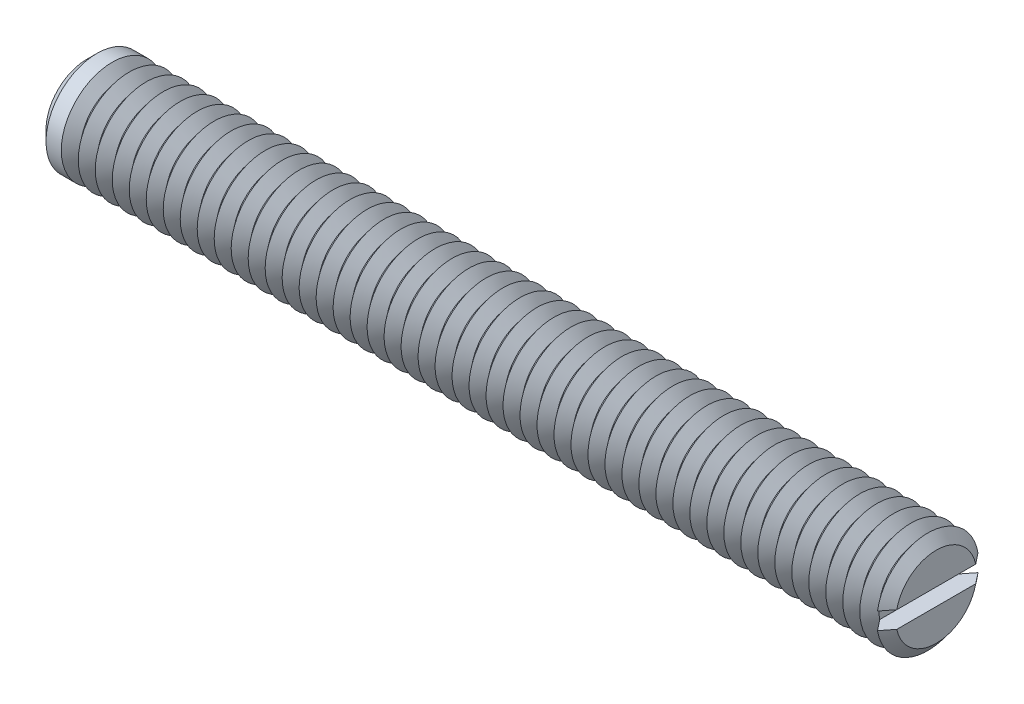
ISO-10303-21;
HEADER;
FILE_DESCRIPTION(('STEP AP214'),'2;1');
FILE_NAME('part.step','',(''),(''),'','','');
FILE_SCHEMA(('AUTOMOTIVE_DESIGN { 1 0 10303 214 1 1 1 1 }'));
ENDSEC;
DATA;
#1=APPLICATION_CONTEXT('core data for automotive mechanical design processes');
#2=APPLICATION_PROTOCOL_DEFINITION('international standard','automotive_design',2000,#1);
#3=PRODUCT_CONTEXT('',#1,'mechanical');
#4=PRODUCT('Part','Part','',(#3));
#5=PRODUCT_RELATED_PRODUCT_CATEGORY('part','',(#4));
#6=PRODUCT_DEFINITION_FORMATION('','',#4);
#7=PRODUCT_DEFINITION_CONTEXT('part definition',#1,'design');
#8=PRODUCT_DEFINITION('design','',#6,#7);
#9=PRODUCT_DEFINITION_SHAPE('','',#8);
#10=(LENGTH_UNIT() NAMED_UNIT(*) SI_UNIT(.MILLI.,.METRE.));
#11=(NAMED_UNIT(*) PLANE_ANGLE_UNIT() SI_UNIT($,.RADIAN.));
#12=(NAMED_UNIT(*) SI_UNIT($,.STERADIAN.) SOLID_ANGLE_UNIT());
#13=UNCERTAINTY_MEASURE_WITH_UNIT(LENGTH_MEASURE(1.E-05),#10,'distance_accuracy_value','');
#14=(GEOMETRIC_REPRESENTATION_CONTEXT(3) GLOBAL_UNCERTAINTY_ASSIGNED_CONTEXT((#13)) GLOBAL_UNIT_ASSIGNED_CONTEXT((#10,
#11,#12)) REPRESENTATION_CONTEXT('',''));
#15=CARTESIAN_POINT('',(0.,0.,0.));
#16=DIRECTION('',(0.,0.,1.));
#17=DIRECTION('',(1.,0.,0.));
#18=AXIS2_PLACEMENT_3D('',#15,#16,#17);
#19=CARTESIAN_POINT('',(24.5,0.,0.));
#20=DIRECTION('',(1.,0.,0.));
#21=DIRECTION('',(0.,0.,-1.));
#22=AXIS2_PLACEMENT_3D('',#19,#20,#21);
#23=CONICAL_SURFACE('',#22,3.,0.895664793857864);
#24=CARTESIAN_POINT('',(24.5,0.,0.));
#25=DIRECTION('',(-1.,0.,0.));
#26=DIRECTION('',(0.,0.,1.));
#27=AXIS2_PLACEMENT_3D('',#24,#25,#26);
#28=CIRCLE('',#27,3.);
#29=CARTESIAN_POINT('',(24.5,-0.5,-2.95803989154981));
#30=VERTEX_POINT('',#29);
#31=CARTESIAN_POINT('',(24.5,-0.5,2.95803989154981));
#32=VERTEX_POINT('',#31);
#33=EDGE_CURVE('E117',#30,#32,#28,.T.);
#34=ORIENTED_EDGE('',*,*,#33,.T.);
#35=CARTESIAN_POINT('',(27.3340158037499,-0.5,-6.52054251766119));
#36=CARTESIAN_POINT('',(27.1513674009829,-0.5,-6.29173953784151));
#37=CARTESIAN_POINT('',(26.9687482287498,-0.5,-6.0629132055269));
#38=CARTESIAN_POINT('',(26.6035782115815,-0.5,-5.60514706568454));
#39=CARTESIAN_POINT('',(26.4210273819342,-0.5,-5.37620724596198));
#40=CARTESIAN_POINT('',(26.0555297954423,-0.5,-4.91755222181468));
#41=CARTESIAN_POINT('',(25.8725834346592,-0.5,-4.68783670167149));
#42=CARTESIAN_POINT('',(25.5069310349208,-0.5,-4.22827290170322));
#43=CARTESIAN_POINT('',(25.3242249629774,-0.5,-3.99842464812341));
#44=CARTESIAN_POINT('',(24.9431833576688,-0.5,-3.51834247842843));
#45=CARTESIAN_POINT('',(24.744878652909,-0.5,-3.26808406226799));
#46=CARTESIAN_POINT('',(24.4479597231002,-0.5,-2.89216906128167));
#47=CARTESIAN_POINT('',(24.3490516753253,-0.5,-2.76674461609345));
#48=CARTESIAN_POINT('',(24.1515374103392,-0.5,-2.51567085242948));
#49=CARTESIAN_POINT('',(24.0529311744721,-0.5,-2.39002154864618));
#50=CARTESIAN_POINT('',(23.8563868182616,-0.5,-2.1386227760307));
#51=CARTESIAN_POINT('',(23.7584477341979,-0.5,-2.01287406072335));
#52=CARTESIAN_POINT('',(23.5633111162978,-0.5,-1.7607527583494));
#53=CARTESIAN_POINT('',(23.4661137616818,-0.5,-1.63438003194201));
#54=CARTESIAN_POINT('',(23.3214734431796,-0.5,-1.44403413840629));
#55=CARTESIAN_POINT('',(23.2734745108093,-0.5,-1.38048388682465));
#56=CARTESIAN_POINT('',(23.1780284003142,-0.5,-1.25297092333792));
#57=CARTESIAN_POINT('',(23.130581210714,-0.5,-1.18900822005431));
#58=CARTESIAN_POINT('',(23.0365530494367,-0.5,-1.0604855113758));
#59=CARTESIAN_POINT('',(22.9899717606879,-0.5,-0.995925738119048));
#60=CARTESIAN_POINT('',(22.8981961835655,-0.5,-0.865829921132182));
#61=CARTESIAN_POINT('',(22.8530016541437,-0.5,-0.800294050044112));
#62=CARTESIAN_POINT('',(22.7995678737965,-0.5,-0.719528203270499));
#63=CARTESIAN_POINT('',(22.7901114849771,-0.5,-0.705104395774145));
#64=CARTESIAN_POINT('',(22.7713420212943,-0.5,-0.676163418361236));
#65=CARTESIAN_POINT('',(22.762028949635,-0.5,-0.661646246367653));
#66=CARTESIAN_POINT('',(22.7343355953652,-0.5,-0.617935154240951));
#67=CARTESIAN_POINT('',(22.7162024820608,-0.5,-0.588583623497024));
#68=CARTESIAN_POINT('',(22.6808134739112,-0.5,-0.529281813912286));
#69=CARTESIAN_POINT('',(22.6635591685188,-0.5,-0.499330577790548));
#70=CARTESIAN_POINT('',(22.630358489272,-0.5,-0.438714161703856));
#71=CARTESIAN_POINT('',(22.6144119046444,-0.5,-0.408049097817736));
#72=CARTESIAN_POINT('',(22.5785841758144,-0.5,-0.333745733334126));
#73=CARTESIAN_POINT('',(22.5595664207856,-0.5,-0.289676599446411));
#74=CARTESIAN_POINT('',(22.5278600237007,-0.5,-0.199412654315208));
#75=CARTESIAN_POINT('',(22.5151365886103,-0.5,-0.153231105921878));
#76=CARTESIAN_POINT('',(22.501111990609,-0.5,-0.0687562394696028));
#77=CARTESIAN_POINT('',(22.498005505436,-0.5,-0.030783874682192));
#78=CARTESIAN_POINT('',(22.4988722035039,-0.5,0.0450573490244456));
#79=CARTESIAN_POINT('',(22.5028411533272,-0.5,0.0829262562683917));
#80=CARTESIAN_POINT('',(22.5147515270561,-0.5,0.146691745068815));
#81=CARTESIAN_POINT('',(22.5212166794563,-0.5,0.172890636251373));
#82=CARTESIAN_POINT('',(22.5365108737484,-0.5,0.224599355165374));
#83=CARTESIAN_POINT('',(22.5453416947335,-0.5,0.250108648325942));
#84=CARTESIAN_POINT('',(22.5648480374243,-0.5,0.300632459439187));
#85=CARTESIAN_POINT('',(22.5755378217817,-0.5,0.325641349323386));
#86=CARTESIAN_POINT('',(22.598235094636,-0.5,0.37503562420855));
#87=CARTESIAN_POINT('',(22.6102421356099,-0.5,0.399421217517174));
#88=CARTESIAN_POINT('',(22.6509435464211,-0.5,0.478106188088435));
#89=CARTESIAN_POINT('',(22.6816009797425,-0.5,0.53138098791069));
#90=CARTESIAN_POINT('',(22.7454790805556,-0.5,0.636383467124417));
#91=CARTESIAN_POINT('',(22.7787021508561,-0.5,0.688109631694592));
#92=CARTESIAN_POINT('',(22.8467342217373,-0.5,0.790686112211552));
#93=CARTESIAN_POINT('',(22.8815468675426,-0.5,0.841534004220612));
#94=CARTESIAN_POINT('',(22.9520982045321,-0.5,0.942545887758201));
#95=CARTESIAN_POINT('',(22.987836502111,-0.5,0.992710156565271));
#96=CARTESIAN_POINT('',(23.0600131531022,-0.5,1.09268759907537));
#97=CARTESIAN_POINT('',(23.096452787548,-0.5,1.14249984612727));
#98=CARTESIAN_POINT('',(23.1697745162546,-0.5,1.24180476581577));
#99=CARTESIAN_POINT('',(23.2066566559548,-0.5,1.29129740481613));
#100=CARTESIAN_POINT('',(23.3176541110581,-0.5,1.439268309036));
#101=CARTESIAN_POINT('',(23.3922352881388,-0.5,1.53739673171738));
#102=CARTESIAN_POINT('',(23.547080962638,-0.5,1.73962858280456));
#103=CARTESIAN_POINT('',(23.6273934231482,-0.5,1.84369513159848));
#104=CARTESIAN_POINT('',(23.7885076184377,-0.5,2.05144913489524));
#105=CARTESIAN_POINT('',(23.8693093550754,-0.5,2.15513658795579));
#106=CARTESIAN_POINT('',(24.1121843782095,-0.5,2.46584176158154));
#107=CARTESIAN_POINT('',(24.2747224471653,-0.5,2.67249578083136));
#108=CARTESIAN_POINT('',(24.6005180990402,-0.5,3.0854888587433));
#109=CARTESIAN_POINT('',(24.7637761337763,-0.5,3.29182756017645));
#110=CARTESIAN_POINT('',(25.0906371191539,-0.5,3.70422676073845));
#111=CARTESIAN_POINT('',(25.2542400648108,-0.5,3.91028726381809));
#112=CARTESIAN_POINT('',(25.5774242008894,-0.5,4.31690950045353));
#113=CARTESIAN_POINT('',(25.7369999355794,-0.5,4.51747557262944));
#114=CARTESIAN_POINT('',(26.0562886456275,-0.5,4.91850000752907));
#115=CARTESIAN_POINT('',(26.2160016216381,-0.5,5.11895836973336));
#116=CARTESIAN_POINT('',(26.5353926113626,-0.5,5.51963619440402));
#117=CARTESIAN_POINT('',(26.6950705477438,-0.5,5.71985571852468));
#118=CARTESIAN_POINT('',(27.0144964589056,-0.5,6.12023723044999));
#119=CARTESIAN_POINT('',(27.1742444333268,-0.5,6.32039921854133));
#120=CARTESIAN_POINT('',(27.3340158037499,-0.5,6.52054251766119));
#121=B_SPLINE_CURVE_WITH_KNOTS('',3,(#35,#36,#37,#38,#39,#40,#41,#42,#43,#44,#45,#46,#47,#48,
#49,#50,#51,#52,#53,#54,#55,#56,#57,#58,#59,#60,#61,#62,#63,#64,#65,#66,#67,#68,#69,#70,#71,#72,
#73,#74,#75,#76,#77,#78,#79,#80,#81,#82,#83,#84,#85,#86,#87,#88,#89,#90,#91,#92,#93,#94,#95,#96,
#97,#98,#99,#100,#101,#102,#103,#104,#105,#106,#107,#108,#109,#110,#111,#112,#113,#114,#115,
#116,#117,#118,#119,#120),.UNSPECIFIED.,.F.,.F.,(4,2,2,2,2,2,2,2,2,2,2,2,2,2,2,2,2,2,2,2,2,2,2,
2,2,2,2,2,2,2,2,2,2,2,2,2,2,2,2,2,2,2,4),(0.,0.878294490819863,1.75672728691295,
2.63771941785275,3.51857435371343,4.47648054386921,4.95567426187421,5.43483773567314,
5.91300334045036,6.39128103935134,6.63019943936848,6.86911286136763,7.10793700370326,
7.34671939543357,7.39846053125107,7.45020282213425,7.55369448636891,7.65736712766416,
7.76102302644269,7.90476612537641,8.04770552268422,8.16137782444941,8.27498213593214,
8.35581399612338,8.43670681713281,8.51825011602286,8.59976579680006,8.78399479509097,
8.96839847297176,9.15324864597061,9.33802146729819,9.52317177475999,9.7083412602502,
10.0780963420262,10.472454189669,10.8668135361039,11.65555692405,12.4448978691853,
13.2342274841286,14.0031360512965,14.7720482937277,15.5403347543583,16.3086173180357),.UNSPECIFIED.);
#122=CARTESIAN_POINT('',(24.,-0.5,2.32228361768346));
#123=VERTEX_POINT('',#122);
#124=EDGE_CURVE('E109',#123,#32,#121,.T.);
#125=ORIENTED_EDGE('',*,*,#124,.F.);
#126=CARTESIAN_POINT('',(24.,0.,0.));
#127=DIRECTION('',(-1.,0.,0.));
#128=DIRECTION('',(0.,0.,1.));
#129=AXIS2_PLACEMENT_3D('',#126,#127,#128);
#130=CIRCLE('',#129,2.37550020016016);
#131=CARTESIAN_POINT('',(24.,-0.5,-2.32228361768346));
#132=VERTEX_POINT('',#131);
#133=EDGE_CURVE('E608',#132,#123,#130,.T.);
#134=ORIENTED_EDGE('',*,*,#133,.F.);
#135=EDGE_CURVE('E58',#30,#132,#121,.T.);
#136=ORIENTED_EDGE('',*,*,#135,.F.);
#137=EDGE_LOOP('',(#34,#125,#134,#136));
#138=FACE_BOUND('',#137,.T.);
#139=ADVANCED_FACE('F37',(#138),#23,.T.);
#140=CARTESIAN_POINT('',(24.5,0.5,2.95803989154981));
#141=VERTEX_POINT('',#140);
#142=CARTESIAN_POINT('',(24.5,0.5,-2.95803989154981));
#143=VERTEX_POINT('',#142);
#144=EDGE_CURVE('E100',#141,#143,#28,.T.);
#145=ORIENTED_EDGE('',*,*,#144,.T.);
#146=CARTESIAN_POINT('',(27.3340158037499,0.5,6.52054251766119));
#147=CARTESIAN_POINT('',(27.1513674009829,0.5,6.29173953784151));
#148=CARTESIAN_POINT('',(26.9687482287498,0.5,6.0629132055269));
#149=CARTESIAN_POINT('',(26.6035782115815,0.5,5.60514706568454));
#150=CARTESIAN_POINT('',(26.4210273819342,0.5,5.37620724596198));
#151=CARTESIAN_POINT('',(26.0555297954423,0.5,4.91755222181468));
#152=CARTESIAN_POINT('',(25.8725834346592,0.5,4.68783670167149));
#153=CARTESIAN_POINT('',(25.5069310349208,0.5,4.22827290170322));
#154=CARTESIAN_POINT('',(25.3242249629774,0.5,3.99842464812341));
#155=CARTESIAN_POINT('',(24.9431833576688,0.5,3.51834247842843));
#156=CARTESIAN_POINT('',(24.744878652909,0.5,3.26808406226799));
#157=CARTESIAN_POINT('',(24.4479597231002,0.5,2.89216906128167));
#158=CARTESIAN_POINT('',(24.3490516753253,0.5,2.76674461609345));
#159=CARTESIAN_POINT('',(24.1515374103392,0.5,2.51567085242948));
#160=CARTESIAN_POINT('',(24.0529311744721,0.5,2.39002154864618));
#161=CARTESIAN_POINT('',(23.8563868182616,0.5,2.1386227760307));
#162=CARTESIAN_POINT('',(23.7584477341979,0.5,2.01287406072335));
#163=CARTESIAN_POINT('',(23.5633111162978,0.5,1.7607527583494));
#164=CARTESIAN_POINT('',(23.4661137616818,0.5,1.63438003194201));
#165=CARTESIAN_POINT('',(23.3214734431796,0.5,1.44403413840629));
#166=CARTESIAN_POINT('',(23.2734745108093,0.5,1.38048388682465));
#167=CARTESIAN_POINT('',(23.1780284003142,0.5,1.25297092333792));
#168=CARTESIAN_POINT('',(23.130581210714,0.5,1.18900822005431));
#169=CARTESIAN_POINT('',(23.0365530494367,0.5,1.0604855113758));
#170=CARTESIAN_POINT('',(22.9899717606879,0.5,0.995925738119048));
#171=CARTESIAN_POINT('',(22.8981961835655,0.5,0.865829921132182));
#172=CARTESIAN_POINT('',(22.8530016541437,0.5,0.800294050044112));
#173=CARTESIAN_POINT('',(22.7995678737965,0.5,0.719528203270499));
#174=CARTESIAN_POINT('',(22.7901114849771,0.5,0.705104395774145));
#175=CARTESIAN_POINT('',(22.7713420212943,0.5,0.676163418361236));
#176=CARTESIAN_POINT('',(22.762028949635,0.5,0.661646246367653));
#177=CARTESIAN_POINT('',(22.7343355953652,0.5,0.617935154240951));
#178=CARTESIAN_POINT('',(22.7162024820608,0.5,0.588583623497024));
#179=CARTESIAN_POINT('',(22.6808134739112,0.5,0.529281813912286));
#180=CARTESIAN_POINT('',(22.6635591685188,0.5,0.499330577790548));
#181=CARTESIAN_POINT('',(22.630358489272,0.5,0.438714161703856));
#182=CARTESIAN_POINT('',(22.6144119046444,0.5,0.408049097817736));
#183=CARTESIAN_POINT('',(22.5785841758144,0.5,0.333745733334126));
#184=CARTESIAN_POINT('',(22.5595664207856,0.5,0.289676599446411));
#185=CARTESIAN_POINT('',(22.5278600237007,0.5,0.199412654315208));
#186=CARTESIAN_POINT('',(22.5151365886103,0.5,0.153231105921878));
#187=CARTESIAN_POINT('',(22.501111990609,0.5,0.0687562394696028));
#188=CARTESIAN_POINT('',(22.498005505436,0.5,0.030783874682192));
#189=CARTESIAN_POINT('',(22.4988722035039,0.5,-0.0450573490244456));
#190=CARTESIAN_POINT('',(22.5028411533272,0.5,-0.0829262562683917));
#191=CARTESIAN_POINT('',(22.5147515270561,0.5,-0.146691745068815));
#192=CARTESIAN_POINT('',(22.5212166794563,0.5,-0.172890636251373));
#193=CARTESIAN_POINT('',(22.5365108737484,0.5,-0.224599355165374));
#194=CARTESIAN_POINT('',(22.5453416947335,0.5,-0.250108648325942));
#195=CARTESIAN_POINT('',(22.5648480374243,0.5,-0.300632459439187));
#196=CARTESIAN_POINT('',(22.5755378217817,0.5,-0.325641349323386));
#197=CARTESIAN_POINT('',(22.598235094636,0.5,-0.37503562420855));
#198=CARTESIAN_POINT('',(22.6102421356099,0.5,-0.399421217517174));
#199=CARTESIAN_POINT('',(22.6509435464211,0.5,-0.478106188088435));
#200=CARTESIAN_POINT('',(22.6816009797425,0.5,-0.53138098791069));
#201=CARTESIAN_POINT('',(22.7454790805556,0.5,-0.636383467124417));
#202=CARTESIAN_POINT('',(22.7787021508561,0.5,-0.688109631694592));
#203=CARTESIAN_POINT('',(22.8467342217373,0.5,-0.790686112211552));
#204=CARTESIAN_POINT('',(22.8815468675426,0.5,-0.841534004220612));
#205=CARTESIAN_POINT('',(22.9520982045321,0.5,-0.942545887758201));
#206=CARTESIAN_POINT('',(22.987836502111,0.5,-0.992710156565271));
#207=CARTESIAN_POINT('',(23.0600131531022,0.5,-1.09268759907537));
#208=CARTESIAN_POINT('',(23.096452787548,0.5,-1.14249984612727));
#209=CARTESIAN_POINT('',(23.1697745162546,0.5,-1.24180476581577));
#210=CARTESIAN_POINT('',(23.2066566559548,0.5,-1.29129740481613));
#211=CARTESIAN_POINT('',(23.3176541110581,0.5,-1.439268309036));
#212=CARTESIAN_POINT('',(23.3922352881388,0.5,-1.53739673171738));
#213=CARTESIAN_POINT('',(23.547080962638,0.5,-1.73962858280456));
#214=CARTESIAN_POINT('',(23.6273934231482,0.5,-1.84369513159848));
#215=CARTESIAN_POINT('',(23.7885076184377,0.5,-2.05144913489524));
#216=CARTESIAN_POINT('',(23.8693093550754,0.5,-2.15513658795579));
#217=CARTESIAN_POINT('',(24.1121843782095,0.5,-2.46584176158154));
#218=CARTESIAN_POINT('',(24.2747224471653,0.5,-2.67249578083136));
#219=CARTESIAN_POINT('',(24.6005180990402,0.5,-3.0854888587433));
#220=CARTESIAN_POINT('',(24.7637761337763,0.5,-3.29182756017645));
#221=CARTESIAN_POINT('',(25.0906371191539,0.5,-3.70422676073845));
#222=CARTESIAN_POINT('',(25.2542400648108,0.5,-3.91028726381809));
#223=CARTESIAN_POINT('',(25.5774242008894,0.5,-4.31690950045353));
#224=CARTESIAN_POINT('',(25.7369999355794,0.5,-4.51747557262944));
#225=CARTESIAN_POINT('',(26.0562886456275,0.5,-4.91850000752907));
#226=CARTESIAN_POINT('',(26.2160016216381,0.5,-5.11895836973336));
#227=CARTESIAN_POINT('',(26.5353926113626,0.5,-5.51963619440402));
#228=CARTESIAN_POINT('',(26.6950705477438,0.5,-5.71985571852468));
#229=CARTESIAN_POINT('',(27.0144964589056,0.5,-6.12023723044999));
#230=CARTESIAN_POINT('',(27.1742444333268,0.5,-6.32039921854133));
#231=CARTESIAN_POINT('',(27.3340158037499,0.5,-6.52054251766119));
#232=B_SPLINE_CURVE_WITH_KNOTS('',3,(#146,#147,#148,#149,#150,#151,#152,#153,#154,#155,#156,
#157,#158,#159,#160,#161,#162,#163,#164,#165,#166,#167,#168,#169,#170,#171,#172,#173,#174,#175,
#176,#177,#178,#179,#180,#181,#182,#183,#184,#185,#186,#187,#188,#189,#190,#191,#192,#193,#194,
#195,#196,#197,#198,#199,#200,#201,#202,#203,#204,#205,#206,#207,#208,#209,#210,#211,#212,#213,
#214,#215,#216,#217,#218,#219,#220,#221,#222,#223,#224,#225,#226,#227,#228,#229,#230,#231),
.UNSPECIFIED.,.F.,.F.,(4,2,2,2,2,2,2,2,2,2,2,2,2,2,2,2,2,2,2,2,2,2,2,2,2,2,2,2,2,2,2,2,2,2,2,2,
2,2,2,2,2,2,4),(0.,0.878294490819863,1.75672728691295,2.63771941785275,3.51857435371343,
4.47648054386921,4.95567426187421,5.43483773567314,5.91300334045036,6.39128103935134,
6.63019943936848,6.86911286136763,7.10793700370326,7.34671939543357,7.39846053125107,
7.45020282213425,7.55369448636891,7.65736712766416,7.76102302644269,7.90476612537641,
8.04770552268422,8.16137782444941,8.27498213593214,8.35581399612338,8.43670681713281,
8.51825011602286,8.59976579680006,8.78399479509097,8.96839847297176,9.15324864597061,
9.33802146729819,9.52317177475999,9.7083412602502,10.0780963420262,10.472454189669,
10.8668135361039,11.65555692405,12.4448978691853,13.2342274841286,14.0031360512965,
14.7720482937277,15.5403347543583,16.3086173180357),.UNSPECIFIED.);
#233=CARTESIAN_POINT('',(24.,0.5,-2.32228361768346));
#234=VERTEX_POINT('',#233);
#235=EDGE_CURVE('E110',#234,#143,#232,.T.);
#236=ORIENTED_EDGE('',*,*,#235,.F.);
#237=CARTESIAN_POINT('',(24.,0.5,2.32228361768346));
#238=VERTEX_POINT('',#237);
#239=EDGE_CURVE('E103',#238,#234,#130,.T.);
#240=ORIENTED_EDGE('',*,*,#239,.F.);
#241=EDGE_CURVE('E97',#141,#238,#232,.T.);
#242=ORIENTED_EDGE('',*,*,#241,.F.);
#243=EDGE_LOOP('',(#145,#236,#240,#242));
#244=FACE_BOUND('',#243,.T.);
#245=ADVANCED_FACE('F99',(#244),#23,.T.);
#246=CARTESIAN_POINT('',(24.,0.,0.));
#247=DIRECTION('',(-1.,0.,0.));
#248=DIRECTION('',(0.,0.,1.));
#249=AXIS2_PLACEMENT_3D('',#246,#247,#248);
#250=CONICAL_SURFACE('',#249,2.37550020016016,0.895664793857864);
#251=CARTESIAN_POINT('',(23.5,0.,0.));
#252=DIRECTION('',(-1.,0.,0.));
#253=DIRECTION('',(0.,0.,1.));
#254=AXIS2_PLACEMENT_3D('',#251,#252,#253);
#255=CIRCLE('',#254,3.);
#256=CARTESIAN_POINT('',(23.5,0.,3.));
#257=VERTEX_POINT('',#256);
#258=EDGE_CURVE('E596',#257,#257,#255,.T.);
#259=ORIENTED_EDGE('',*,*,#258,.F.);
#260=EDGE_LOOP('',(#259));
#261=FACE_BOUND('',#260,.T.);
#262=ORIENTED_EDGE('',*,*,#239,.T.);
#263=EDGE_CURVE('E603',#234,#132,#130,.T.);
#264=ORIENTED_EDGE('',*,*,#263,.T.);
#265=ORIENTED_EDGE('',*,*,#133,.T.);
#266=EDGE_CURVE('E602',#123,#238,#130,.T.);
#267=ORIENTED_EDGE('',*,*,#266,.T.);
#268=EDGE_LOOP('',(#262,#264,#265,#267));
#269=FACE_BOUND('',#268,.T.);
#270=ADVANCED_FACE('F166',(#261,#269),#250,.T.);
#271=CARTESIAN_POINT('',(25.,0.,0.));
#272=DIRECTION('',(1.,0.,0.));
#273=DIRECTION('',(0.,0.,-1.));
#274=AXIS2_PLACEMENT_3D('',#271,#272,#273);
#275=PLANE('',#274);
#276=CARTESIAN_POINT('',(25.,0.,0.));
#277=DIRECTION('',(-1.,0.,0.));
#278=DIRECTION('',(0.,0.,1.));
#279=AXIS2_PLACEMENT_3D('',#276,#277,#278);
#280=CIRCLE('',#279,2.37550020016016);
#281=CARTESIAN_POINT('',(25.,0.5,2.32228361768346));
#282=VERTEX_POINT('',#281);
#283=CARTESIAN_POINT('',(25.,0.5,-2.32228361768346));
#284=VERTEX_POINT('',#283);
#285=EDGE_CURVE('E158',#282,#284,#280,.T.);
#286=ORIENTED_EDGE('',*,*,#285,.F.);
#287=DIRECTION('',(0.,0.,1.));
#288=VECTOR('',#287,1.);
#289=CARTESIAN_POINT('',(25.,0.5,0.));
#290=LINE('',#289,#288);
#291=EDGE_CURVE('E122',#284,#282,#290,.T.);
#292=ORIENTED_EDGE('',*,*,#291,.F.);
#293=EDGE_LOOP('',(#286,#292));
#294=FACE_BOUND('',#293,.T.);
#295=ADVANCED_FACE('F170',(#294),#275,.T.);
#296=CARTESIAN_POINT('',(25.,-0.5,-2.32228361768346));
#297=VERTEX_POINT('',#296);
#298=CARTESIAN_POINT('',(25.,-0.5,2.32228361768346));
#299=VERTEX_POINT('',#298);
#300=EDGE_CURVE('E66',#297,#299,#280,.T.);
#301=ORIENTED_EDGE('',*,*,#300,.F.);
#302=DIRECTION('',(0.,0.,-1.));
#303=VECTOR('',#302,1.);
#304=CARTESIAN_POINT('',(25.,-0.5,0.));
#305=LINE('',#304,#303);
#306=EDGE_CURVE('E135',#299,#297,#305,.T.);
#307=ORIENTED_EDGE('',*,*,#306,.F.);
#308=EDGE_LOOP('',(#301,#307));
#309=FACE_BOUND('',#308,.T.);
#310=ADVANCED_FACE('F200',(#309),#275,.T.);
#311=CARTESIAN_POINT('',(25.,0.,0.));
#312=DIRECTION('',(-1.,0.,0.));
#313=DIRECTION('',(0.,0.,1.));
#314=AXIS2_PLACEMENT_3D('',#311,#312,#313);
#315=CONICAL_SURFACE('',#314,2.37550020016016,0.895664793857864);
#316=ORIENTED_EDGE('',*,*,#144,.F.);
#317=CARTESIAN_POINT('',(21.6659841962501,0.5,-6.52054251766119));
#318=CARTESIAN_POINT('',(21.8486325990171,0.5,-6.29173953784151));
#319=CARTESIAN_POINT('',(22.0312517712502,0.5,-6.06291320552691));
#320=CARTESIAN_POINT('',(22.3964217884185,0.5,-5.60514706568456));
#321=CARTESIAN_POINT('',(22.5789726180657,0.5,-5.37620724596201));
#322=CARTESIAN_POINT('',(22.9444702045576,0.5,-4.91755222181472));
#323=CARTESIAN_POINT('',(23.1274165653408,0.5,-4.68783670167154));
#324=CARTESIAN_POINT('',(23.4930689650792,0.5,-4.22827290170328));
#325=CARTESIAN_POINT('',(23.6757750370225,0.5,-3.99842464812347));
#326=CARTESIAN_POINT('',(24.0568166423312,0.5,-3.51834247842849));
#327=CARTESIAN_POINT('',(24.2551213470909,0.5,-3.26808406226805));
#328=CARTESIAN_POINT('',(24.5520402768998,0.5,-2.89216906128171));
#329=CARTESIAN_POINT('',(24.6509483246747,0.5,-2.76674461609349));
#330=CARTESIAN_POINT('',(24.8484625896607,0.5,-2.51567085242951));
#331=CARTESIAN_POINT('',(24.9470688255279,0.5,-2.39002154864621));
#332=CARTESIAN_POINT('',(25.1436131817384,0.5,-2.13862277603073));
#333=CARTESIAN_POINT('',(25.2415522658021,0.5,-2.01287406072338));
#334=CARTESIAN_POINT('',(25.4366888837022,0.5,-1.76075275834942));
#335=CARTESIAN_POINT('',(25.5338862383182,0.5,-1.63438003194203));
#336=CARTESIAN_POINT('',(25.6785265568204,0.5,-1.44403413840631));
#337=CARTESIAN_POINT('',(25.7265254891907,0.5,-1.38048388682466));
#338=CARTESIAN_POINT('',(25.8219715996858,0.5,-1.25297092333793));
#339=CARTESIAN_POINT('',(25.869418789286,0.5,-1.18900822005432));
#340=CARTESIAN_POINT('',(25.9634469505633,0.5,-1.06048551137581));
#341=CARTESIAN_POINT('',(26.0100282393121,0.5,-0.995925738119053));
#342=CARTESIAN_POINT('',(26.1018038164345,0.5,-0.865829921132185));
#343=CARTESIAN_POINT('',(26.1469983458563,0.5,-0.800294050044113));
#344=CARTESIAN_POINT('',(26.2004321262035,0.5,-0.719528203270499));
#345=CARTESIAN_POINT('',(26.2098885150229,0.5,-0.705104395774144));
#346=CARTESIAN_POINT('',(26.2286579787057,0.5,-0.676163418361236));
#347=CARTESIAN_POINT('',(26.237971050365,0.5,-0.661646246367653));
#348=CARTESIAN_POINT('',(26.2656644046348,0.5,-0.61793515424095));
#349=CARTESIAN_POINT('',(26.2837975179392,0.5,-0.588583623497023));
#350=CARTESIAN_POINT('',(26.3191865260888,0.5,-0.529281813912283));
#351=CARTESIAN_POINT('',(26.3364408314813,0.5,-0.499330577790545));
#352=CARTESIAN_POINT('',(26.369641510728,0.5,-0.438714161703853));
#353=CARTESIAN_POINT('',(26.3855880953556,0.5,-0.408049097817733));
#354=CARTESIAN_POINT('',(26.4214158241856,0.5,-0.333745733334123));
#355=CARTESIAN_POINT('',(26.4404335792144,0.5,-0.289676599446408));
#356=CARTESIAN_POINT('',(26.4721399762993,0.5,-0.199412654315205));
#357=CARTESIAN_POINT('',(26.4848634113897,0.5,-0.153231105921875));
#358=CARTESIAN_POINT('',(26.498888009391,0.5,-0.0687562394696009));
#359=CARTESIAN_POINT('',(26.501994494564,0.5,-0.0307838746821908));
#360=CARTESIAN_POINT('',(26.5011277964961,0.5,0.0450573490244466));
#361=CARTESIAN_POINT('',(26.4971588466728,0.5,0.0829262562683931));
#362=CARTESIAN_POINT('',(26.4852484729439,0.5,0.146691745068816));
#363=CARTESIAN_POINT('',(26.4787833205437,0.5,0.172890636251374));
#364=CARTESIAN_POINT('',(26.4634891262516,0.5,0.224599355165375));
#365=CARTESIAN_POINT('',(26.4546583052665,0.5,0.250108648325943));
#366=CARTESIAN_POINT('',(26.4351519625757,0.5,0.300632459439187));
#367=CARTESIAN_POINT('',(26.4244621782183,0.5,0.325641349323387));
#368=CARTESIAN_POINT('',(26.401764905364,0.5,0.375035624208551));
#369=CARTESIAN_POINT('',(26.3897578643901,0.5,0.399421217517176));
#370=CARTESIAN_POINT('',(26.349056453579,0.5,0.478106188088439));
#371=CARTESIAN_POINT('',(26.3183990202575,0.5,0.531380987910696));
#372=CARTESIAN_POINT('',(26.2545209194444,0.5,0.636383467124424));
#373=CARTESIAN_POINT('',(26.2212978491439,0.5,0.688109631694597));
#374=CARTESIAN_POINT('',(26.1532657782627,0.5,0.790686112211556));
#375=CARTESIAN_POINT('',(26.1184531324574,0.5,0.841534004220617));
#376=CARTESIAN_POINT('',(26.0479017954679,0.5,0.942545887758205));
#377=CARTESIAN_POINT('',(26.012163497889,0.5,0.992710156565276));
#378=CARTESIAN_POINT('',(25.9399868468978,0.5,1.09268759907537));
#379=CARTESIAN_POINT('',(25.903547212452,0.5,1.14249984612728));
#380=CARTESIAN_POINT('',(25.8302254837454,0.5,1.24180476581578));
#381=CARTESIAN_POINT('',(25.7933433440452,0.5,1.29129740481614));
#382=CARTESIAN_POINT('',(25.6823458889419,0.5,1.43926830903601));
#383=CARTESIAN_POINT('',(25.6077647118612,0.5,1.53739673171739));
#384=CARTESIAN_POINT('',(25.452919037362,0.5,1.73962858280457));
#385=CARTESIAN_POINT('',(25.3726065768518,0.5,1.84369513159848));
#386=CARTESIAN_POINT('',(25.2114923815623,0.5,2.05144913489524));
#387=CARTESIAN_POINT('',(25.1306906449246,0.5,2.1551365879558));
#388=CARTESIAN_POINT('',(24.8878156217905,0.5,2.46584176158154));
#389=CARTESIAN_POINT('',(24.7252775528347,0.5,2.67249578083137));
#390=CARTESIAN_POINT('',(24.3994819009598,0.5,3.08548885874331));
#391=CARTESIAN_POINT('',(24.2362238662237,0.5,3.29182756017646));
#392=CARTESIAN_POINT('',(23.9093628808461,0.5,3.70422676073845));
#393=CARTESIAN_POINT('',(23.7457599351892,0.5,3.9102872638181));
#394=CARTESIAN_POINT('',(23.4225757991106,0.5,4.31690950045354));
#395=CARTESIAN_POINT('',(23.2630000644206,0.5,4.51747557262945));
#396=CARTESIAN_POINT('',(22.9437113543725,0.5,4.91850000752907));
#397=CARTESIAN_POINT('',(22.7839983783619,0.5,5.11895836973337));
#398=CARTESIAN_POINT('',(22.4646073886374,0.5,5.51963619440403));
#399=CARTESIAN_POINT('',(22.3049294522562,0.5,5.71985571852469));
#400=CARTESIAN_POINT('',(21.9855035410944,0.5,6.12023723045));
#401=CARTESIAN_POINT('',(21.8257555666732,0.5,6.32039921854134));
#402=CARTESIAN_POINT('',(21.6659841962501,0.5,6.52054251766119));
#403=B_SPLINE_CURVE_WITH_KNOTS('',3,(#317,#318,#319,#320,#321,#322,#323,#324,#325,#326,#327,
#328,#329,#330,#331,#332,#333,#334,#335,#336,#337,#338,#339,#340,#341,#342,#343,#344,#345,#346,
#347,#348,#349,#350,#351,#352,#353,#354,#355,#356,#357,#358,#359,#360,#361,#362,#363,#364,#365,
#366,#367,#368,#369,#370,#371,#372,#373,#374,#375,#376,#377,#378,#379,#380,#381,#382,#383,#384,
#385,#386,#387,#388,#389,#390,#391,#392,#393,#394,#395,#396,#397,#398,#399,#400,#401,#402),
.UNSPECIFIED.,.F.,.F.,(4,2,2,2,2,2,2,2,2,2,2,2,2,2,2,2,2,2,2,2,2,2,2,2,2,2,2,2,2,2,2,2,2,2,2,2,
2,2,2,2,2,2,4),(0.,0.878294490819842,1.75672728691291,2.63771941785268,3.51857435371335,
4.47648054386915,4.95567426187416,5.4348377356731,5.91300334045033,6.39128103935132,
6.63019943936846,6.86911286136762,7.10793700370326,7.34671939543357,7.39846053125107,
7.45020282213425,7.55369448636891,7.65736712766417,7.7610230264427,7.90476612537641,
8.04770552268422,8.16137782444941,8.27498213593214,8.35581399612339,8.43670681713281,
8.51825011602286,8.59976579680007,8.78399479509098,8.96839847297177,9.15324864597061,
9.3380214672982,9.52317177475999,9.70834126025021,10.0780963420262,10.472454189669,
10.8668135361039,11.65555692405,12.4448978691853,13.2342274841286,14.0031360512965,
14.7720482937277,15.5403347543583,16.3086173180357),.UNSPECIFIED.);
#404=EDGE_CURVE('E41',#282,#141,#403,.T.);
#405=ORIENTED_EDGE('',*,*,#404,.F.);
#406=ORIENTED_EDGE('',*,*,#285,.T.);
#407=EDGE_CURVE('E11',#143,#284,#403,.T.);
#408=ORIENTED_EDGE('',*,*,#407,.F.);
#409=EDGE_LOOP('',(#316,#405,#406,#408));
#410=FACE_BOUND('',#409,.T.);
#411=ADVANCED_FACE('F114',(#410),#315,.T.);
#412=CARTESIAN_POINT('',(25.,0.5,-4.5));
#413=DIRECTION('',(0.,1.,0.));
#414=DIRECTION('',(0.,0.,1.));
#415=AXIS2_PLACEMENT_3D('',#412,#413,#414);
#416=PLANE('',#415);
#417=ORIENTED_EDGE('',*,*,#404,.T.);
#418=ORIENTED_EDGE('',*,*,#241,.T.);
#419=DIRECTION('',(0.,0.,1.));
#420=VECTOR('',#419,1.);
#421=CARTESIAN_POINT('',(24.,0.5,-4.5));
#422=LINE('',#421,#420);
#423=EDGE_CURVE('E144',#234,#238,#422,.T.);
#424=ORIENTED_EDGE('',*,*,#423,.F.);
#425=ORIENTED_EDGE('',*,*,#235,.T.);
#426=ORIENTED_EDGE('',*,*,#407,.T.);
#427=ORIENTED_EDGE('',*,*,#291,.T.);
#428=EDGE_LOOP('',(#417,#418,#424,#425,#426,#427));
#429=FACE_BOUND('',#428,.T.);
#430=ADVANCED_FACE('F120',(#429),#416,.F.);
#431=ORIENTED_EDGE('',*,*,#33,.F.);
#432=CARTESIAN_POINT('',(21.6659841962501,-0.5,6.52054251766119));
#433=CARTESIAN_POINT('',(21.8486325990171,-0.5,6.29173953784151));
#434=CARTESIAN_POINT('',(22.0312517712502,-0.5,6.06291320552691));
#435=CARTESIAN_POINT('',(22.3964217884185,-0.5,5.60514706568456));
#436=CARTESIAN_POINT('',(22.5789726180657,-0.5,5.37620724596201));
#437=CARTESIAN_POINT('',(22.9444702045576,-0.5,4.91755222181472));
#438=CARTESIAN_POINT('',(23.1274165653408,-0.5,4.68783670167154));
#439=CARTESIAN_POINT('',(23.4930689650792,-0.5,4.22827290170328));
#440=CARTESIAN_POINT('',(23.6757750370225,-0.5,3.99842464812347));
#441=CARTESIAN_POINT('',(24.0568166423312,-0.5,3.51834247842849));
#442=CARTESIAN_POINT('',(24.2551213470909,-0.5,3.26808406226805));
#443=CARTESIAN_POINT('',(24.5520402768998,-0.5,2.89216906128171));
#444=CARTESIAN_POINT('',(24.6509483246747,-0.5,2.76674461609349));
#445=CARTESIAN_POINT('',(24.8484625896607,-0.5,2.51567085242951));
#446=CARTESIAN_POINT('',(24.9470688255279,-0.5,2.39002154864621));
#447=CARTESIAN_POINT('',(25.1436131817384,-0.5,2.13862277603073));
#448=CARTESIAN_POINT('',(25.2415522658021,-0.5,2.01287406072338));
#449=CARTESIAN_POINT('',(25.4366888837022,-0.5,1.76075275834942));
#450=CARTESIAN_POINT('',(25.5338862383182,-0.5,1.63438003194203));
#451=CARTESIAN_POINT('',(25.6785265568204,-0.5,1.44403413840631));
#452=CARTESIAN_POINT('',(25.7265254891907,-0.5,1.38048388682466));
#453=CARTESIAN_POINT('',(25.8219715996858,-0.5,1.25297092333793));
#454=CARTESIAN_POINT('',(25.869418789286,-0.5,1.18900822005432));
#455=CARTESIAN_POINT('',(25.9634469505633,-0.5,1.06048551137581));
#456=CARTESIAN_POINT('',(26.0100282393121,-0.5,0.995925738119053));
#457=CARTESIAN_POINT('',(26.1018038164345,-0.5,0.865829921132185));
#458=CARTESIAN_POINT('',(26.1469983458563,-0.5,0.800294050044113));
#459=CARTESIAN_POINT('',(26.2004321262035,-0.5,0.719528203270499));
#460=CARTESIAN_POINT('',(26.2098885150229,-0.5,0.705104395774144));
#461=CARTESIAN_POINT('',(26.2286579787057,-0.5,0.676163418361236));
#462=CARTESIAN_POINT('',(26.237971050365,-0.5,0.661646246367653));
#463=CARTESIAN_POINT('',(26.2656644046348,-0.5,0.61793515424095));
#464=CARTESIAN_POINT('',(26.2837975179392,-0.5,0.588583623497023));
#465=CARTESIAN_POINT('',(26.3191865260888,-0.5,0.529281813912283));
#466=CARTESIAN_POINT('',(26.3364408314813,-0.5,0.499330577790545));
#467=CARTESIAN_POINT('',(26.369641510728,-0.5,0.438714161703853));
#468=CARTESIAN_POINT('',(26.3855880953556,-0.5,0.408049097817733));
#469=CARTESIAN_POINT('',(26.4214158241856,-0.5,0.333745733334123));
#470=CARTESIAN_POINT('',(26.4404335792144,-0.5,0.289676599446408));
#471=CARTESIAN_POINT('',(26.4721399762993,-0.5,0.199412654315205));
#472=CARTESIAN_POINT('',(26.4848634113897,-0.5,0.153231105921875));
#473=CARTESIAN_POINT('',(26.498888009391,-0.5,0.0687562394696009));
#474=CARTESIAN_POINT('',(26.501994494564,-0.5,0.0307838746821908));
#475=CARTESIAN_POINT('',(26.5011277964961,-0.5,-0.0450573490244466));
#476=CARTESIAN_POINT('',(26.4971588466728,-0.5,-0.0829262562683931));
#477=CARTESIAN_POINT('',(26.4852484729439,-0.5,-0.146691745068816));
#478=CARTESIAN_POINT('',(26.4787833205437,-0.5,-0.172890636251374));
#479=CARTESIAN_POINT('',(26.4634891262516,-0.5,-0.224599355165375));
#480=CARTESIAN_POINT('',(26.4546583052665,-0.5,-0.250108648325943));
#481=CARTESIAN_POINT('',(26.4351519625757,-0.5,-0.300632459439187));
#482=CARTESIAN_POINT('',(26.4244621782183,-0.5,-0.325641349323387));
#483=CARTESIAN_POINT('',(26.401764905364,-0.5,-0.375035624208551));
#484=CARTESIAN_POINT('',(26.3897578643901,-0.5,-0.399421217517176));
#485=CARTESIAN_POINT('',(26.349056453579,-0.5,-0.478106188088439));
#486=CARTESIAN_POINT('',(26.3183990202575,-0.5,-0.531380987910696));
#487=CARTESIAN_POINT('',(26.2545209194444,-0.5,-0.636383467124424));
#488=CARTESIAN_POINT('',(26.2212978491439,-0.5,-0.688109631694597));
#489=CARTESIAN_POINT('',(26.1532657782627,-0.5,-0.790686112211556));
#490=CARTESIAN_POINT('',(26.1184531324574,-0.5,-0.841534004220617));
#491=CARTESIAN_POINT('',(26.0479017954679,-0.5,-0.942545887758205));
#492=CARTESIAN_POINT('',(26.012163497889,-0.5,-0.992710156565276));
#493=CARTESIAN_POINT('',(25.9399868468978,-0.5,-1.09268759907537));
#494=CARTESIAN_POINT('',(25.903547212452,-0.5,-1.14249984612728));
#495=CARTESIAN_POINT('',(25.8302254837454,-0.5,-1.24180476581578));
#496=CARTESIAN_POINT('',(25.7933433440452,-0.5,-1.29129740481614));
#497=CARTESIAN_POINT('',(25.6823458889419,-0.5,-1.43926830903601));
#498=CARTESIAN_POINT('',(25.6077647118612,-0.5,-1.53739673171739));
#499=CARTESIAN_POINT('',(25.452919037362,-0.5,-1.73962858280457));
#500=CARTESIAN_POINT('',(25.3726065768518,-0.5,-1.84369513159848));
#501=CARTESIAN_POINT('',(25.2114923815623,-0.5,-2.05144913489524));
#502=CARTESIAN_POINT('',(25.1306906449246,-0.5,-2.1551365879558));
#503=CARTESIAN_POINT('',(24.8878156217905,-0.5,-2.46584176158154));
#504=CARTESIAN_POINT('',(24.7252775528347,-0.5,-2.67249578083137));
#505=CARTESIAN_POINT('',(24.3994819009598,-0.5,-3.08548885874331));
#506=CARTESIAN_POINT('',(24.2362238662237,-0.5,-3.29182756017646));
#507=CARTESIAN_POINT('',(23.9093628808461,-0.5,-3.70422676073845));
#508=CARTESIAN_POINT('',(23.7457599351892,-0.5,-3.9102872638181));
#509=CARTESIAN_POINT('',(23.4225757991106,-0.5,-4.31690950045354));
#510=CARTESIAN_POINT('',(23.2630000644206,-0.5,-4.51747557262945));
#511=CARTESIAN_POINT('',(22.9437113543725,-0.5,-4.91850000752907));
#512=CARTESIAN_POINT('',(22.7839983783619,-0.5,-5.11895836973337));
#513=CARTESIAN_POINT('',(22.4646073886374,-0.5,-5.51963619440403));
#514=CARTESIAN_POINT('',(22.3049294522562,-0.5,-5.71985571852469));
#515=CARTESIAN_POINT('',(21.9855035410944,-0.5,-6.12023723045));
#516=CARTESIAN_POINT('',(21.8257555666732,-0.5,-6.32039921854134));
#517=CARTESIAN_POINT('',(21.6659841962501,-0.5,-6.52054251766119));
#518=B_SPLINE_CURVE_WITH_KNOTS('',3,(#432,#433,#434,#435,#436,#437,#438,#439,#440,#441,#442,
#443,#444,#445,#446,#447,#448,#449,#450,#451,#452,#453,#454,#455,#456,#457,#458,#459,#460,#461,
#462,#463,#464,#465,#466,#467,#468,#469,#470,#471,#472,#473,#474,#475,#476,#477,#478,#479,#480,
#481,#482,#483,#484,#485,#486,#487,#488,#489,#490,#491,#492,#493,#494,#495,#496,#497,#498,#499,
#500,#501,#502,#503,#504,#505,#506,#507,#508,#509,#510,#511,#512,#513,#514,#515,#516,#517),
.UNSPECIFIED.,.F.,.F.,(4,2,2,2,2,2,2,2,2,2,2,2,2,2,2,2,2,2,2,2,2,2,2,2,2,2,2,2,2,2,2,2,2,2,2,2,
2,2,2,2,2,2,4),(0.,0.878294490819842,1.75672728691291,2.63771941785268,3.51857435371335,
4.47648054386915,4.95567426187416,5.4348377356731,5.91300334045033,6.39128103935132,
6.63019943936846,6.86911286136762,7.10793700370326,7.34671939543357,7.39846053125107,
7.45020282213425,7.55369448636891,7.65736712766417,7.7610230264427,7.90476612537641,
8.04770552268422,8.16137782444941,8.27498213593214,8.35581399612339,8.43670681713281,
8.51825011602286,8.59976579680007,8.78399479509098,8.96839847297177,9.15324864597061,
9.3380214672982,9.52317177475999,9.70834126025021,10.0780963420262,10.472454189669,
10.8668135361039,11.65555692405,12.4448978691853,13.2342274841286,14.0031360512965,
14.7720482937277,15.5403347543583,16.3086173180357),.UNSPECIFIED.);
#519=EDGE_CURVE('E151',#297,#30,#518,.T.);
#520=ORIENTED_EDGE('',*,*,#519,.F.);
#521=ORIENTED_EDGE('',*,*,#300,.T.);
#522=EDGE_CURVE('E147',#32,#299,#518,.T.);
#523=ORIENTED_EDGE('',*,*,#522,.F.);
#524=EDGE_LOOP('',(#431,#520,#521,#523));
#525=FACE_BOUND('',#524,.T.);
#526=ADVANCED_FACE('F162',(#525),#315,.T.);
#527=CARTESIAN_POINT('',(25.,-0.5,-4.5));
#528=DIRECTION('',(0.,-1.,0.));
#529=DIRECTION('',(0.,0.,-1.));
#530=AXIS2_PLACEMENT_3D('',#527,#528,#529);
#531=PLANE('',#530);
#532=ORIENTED_EDGE('',*,*,#519,.T.);
#533=ORIENTED_EDGE('',*,*,#135,.T.);
#534=DIRECTION('',(0.,0.,1.));
#535=VECTOR('',#534,1.);
#536=CARTESIAN_POINT('',(24.,-0.5,-4.5));
#537=LINE('',#536,#535);
#538=EDGE_CURVE('E143',#132,#123,#537,.T.);
#539=ORIENTED_EDGE('',*,*,#538,.T.);
#540=ORIENTED_EDGE('',*,*,#124,.T.);
#541=ORIENTED_EDGE('',*,*,#522,.T.);
#542=ORIENTED_EDGE('',*,*,#306,.T.);
#543=EDGE_LOOP('',(#532,#533,#539,#540,#541,#542));
#544=FACE_BOUND('',#543,.T.);
#545=ADVANCED_FACE('F159',(#544),#531,.F.);
#546=CARTESIAN_POINT('',(24.,0.5,-4.5));
#547=DIRECTION('',(-1.,0.,0.));
#548=DIRECTION('',(0.,0.,1.));
#549=AXIS2_PLACEMENT_3D('',#546,#547,#548);
#550=PLANE('',#549);
#551=ORIENTED_EDGE('',*,*,#538,.F.);
#552=ORIENTED_EDGE('',*,*,#263,.F.);
#553=ORIENTED_EDGE('',*,*,#423,.T.);
#554=ORIENTED_EDGE('',*,*,#266,.F.);
#555=EDGE_LOOP('',(#551,#552,#553,#554));
#556=FACE_BOUND('',#555,.T.);
#557=ADVANCED_FACE('F613',(#556),#550,.F.);
#558=CARTESIAN_POINT('',(23.,0.,0.));
#559=DIRECTION('',(-1.,0.,0.));
#560=DIRECTION('',(0.,0.,1.));
#561=AXIS2_PLACEMENT_3D('',#558,#559,#560);
#562=CONICAL_SURFACE('',#561,2.37550020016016,0.895664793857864);
#563=CARTESIAN_POINT('',(22.5,0.,0.));
#564=DIRECTION('',(-1.,0.,0.));
#565=DIRECTION('',(0.,0.,1.));
#566=AXIS2_PLACEMENT_3D('',#563,#564,#565);
#567=CIRCLE('',#566,3.);
#568=CARTESIAN_POINT('',(22.5,0.,3.));
#569=VERTEX_POINT('',#568);
#570=EDGE_CURVE('E588',#569,#569,#567,.T.);
#571=ORIENTED_EDGE('',*,*,#570,.F.);
#572=EDGE_LOOP('',(#571));
#573=FACE_BOUND('',#572,.T.);
#574=CARTESIAN_POINT('',(23.,0.,0.));
#575=DIRECTION('',(-1.,0.,0.));
#576=DIRECTION('',(0.,0.,1.));
#577=AXIS2_PLACEMENT_3D('',#574,#575,#576);
#578=CIRCLE('',#577,2.37550020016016);
#579=CARTESIAN_POINT('',(23.,0.,2.37550020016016));
#580=VERTEX_POINT('',#579);
#581=EDGE_CURVE('E600',#580,#580,#578,.T.);
#582=ORIENTED_EDGE('',*,*,#581,.T.);
#583=EDGE_LOOP('',(#582));
#584=FACE_BOUND('',#583,.T.);
#585=ADVANCED_FACE('F175',(#573,#584),#562,.T.);
#586=CARTESIAN_POINT('',(23.5,0.,0.));
#587=DIRECTION('',(1.,0.,0.));
#588=DIRECTION('',(0.,0.,-1.));
#589=AXIS2_PLACEMENT_3D('',#586,#587,#588);
#590=CONICAL_SURFACE('',#589,3.,0.895664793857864);
#591=ORIENTED_EDGE('',*,*,#581,.F.);
#592=EDGE_LOOP('',(#591));
#593=FACE_BOUND('',#592,.T.);
#594=ORIENTED_EDGE('',*,*,#258,.T.);
#595=EDGE_LOOP('',(#594));
#596=FACE_BOUND('',#595,.T.);
#597=ADVANCED_FACE('F619',(#593,#596),#590,.T.);
#598=CARTESIAN_POINT('',(22.,0.,0.));
#599=DIRECTION('',(-1.,0.,0.));
#600=DIRECTION('',(0.,0.,1.));
#601=AXIS2_PLACEMENT_3D('',#598,#599,#600);
#602=CONICAL_SURFACE('',#601,2.37550020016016,0.895664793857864);
#603=CARTESIAN_POINT('',(21.5,0.,0.));
#604=DIRECTION('',(-1.,0.,0.));
#605=DIRECTION('',(0.,0.,1.));
#606=AXIS2_PLACEMENT_3D('',#603,#604,#605);
#607=CIRCLE('',#606,3.);
#608=CARTESIAN_POINT('',(21.5,0.,3.));
#609=VERTEX_POINT('',#608);
#610=EDGE_CURVE('E581',#609,#609,#607,.T.);
#611=ORIENTED_EDGE('',*,*,#610,.F.);
#612=EDGE_LOOP('',(#611));
#613=FACE_BOUND('',#612,.T.);
#614=CARTESIAN_POINT('',(22.,0.,0.));
#615=DIRECTION('',(-1.,0.,0.));
#616=DIRECTION('',(0.,0.,1.));
#617=AXIS2_PLACEMENT_3D('',#614,#615,#616);
#618=CIRCLE('',#617,2.37550020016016);
#619=CARTESIAN_POINT('',(22.,0.,2.37550020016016));
#620=VERTEX_POINT('',#619);
#621=EDGE_CURVE('E592',#620,#620,#618,.T.);
#622=ORIENTED_EDGE('',*,*,#621,.T.);
#623=EDGE_LOOP('',(#622));
#624=FACE_BOUND('',#623,.T.);
#625=ADVANCED_FACE('F683',(#613,#624),#602,.T.);
#626=CARTESIAN_POINT('',(22.5,0.,0.));
#627=DIRECTION('',(1.,0.,0.));
#628=DIRECTION('',(0.,0.,-1.));
#629=AXIS2_PLACEMENT_3D('',#626,#627,#628);
#630=CONICAL_SURFACE('',#629,3.,0.895664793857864);
#631=ORIENTED_EDGE('',*,*,#621,.F.);
#632=EDGE_LOOP('',(#631));
#633=FACE_BOUND('',#632,.T.);
#634=ORIENTED_EDGE('',*,*,#570,.T.);
#635=EDGE_LOOP('',(#634));
#636=FACE_BOUND('',#635,.T.);
#637=ADVANCED_FACE('F692',(#633,#636),#630,.T.);
#638=CARTESIAN_POINT('',(21.,0.,0.));
#639=DIRECTION('',(-1.,0.,0.));
#640=DIRECTION('',(0.,0.,1.));
#641=AXIS2_PLACEMENT_3D('',#638,#639,#640);
#642=CONICAL_SURFACE('',#641,2.37550020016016,0.895664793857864);
#643=CARTESIAN_POINT('',(20.5,0.,0.));
#644=DIRECTION('',(-1.,0.,0.));
#645=DIRECTION('',(0.,0.,1.));
#646=AXIS2_PLACEMENT_3D('',#643,#644,#645);
#647=CIRCLE('',#646,3.);
#648=CARTESIAN_POINT('',(20.5,0.,3.));
#649=VERTEX_POINT('',#648);
#650=EDGE_CURVE('E573',#649,#649,#647,.T.);
#651=ORIENTED_EDGE('',*,*,#650,.F.);
#652=EDGE_LOOP('',(#651));
#653=FACE_BOUND('',#652,.T.);
#654=CARTESIAN_POINT('',(21.,0.,0.));
#655=DIRECTION('',(-1.,0.,0.));
#656=DIRECTION('',(0.,0.,1.));
#657=AXIS2_PLACEMENT_3D('',#654,#655,#656);
#658=CIRCLE('',#657,2.37550020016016);
#659=CARTESIAN_POINT('',(21.,0.,2.37550020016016));
#660=VERTEX_POINT('',#659);
#661=EDGE_CURVE('E585',#660,#660,#658,.T.);
#662=ORIENTED_EDGE('',*,*,#661,.T.);
#663=EDGE_LOOP('',(#662));
#664=FACE_BOUND('',#663,.T.);
#665=ADVANCED_FACE('F702',(#653,#664),#642,.T.);
#666=CARTESIAN_POINT('',(21.5,0.,0.));
#667=DIRECTION('',(1.,0.,0.));
#668=DIRECTION('',(0.,0.,-1.));
#669=AXIS2_PLACEMENT_3D('',#666,#667,#668);
#670=CONICAL_SURFACE('',#669,3.,0.895664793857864);
#671=ORIENTED_EDGE('',*,*,#661,.F.);
#672=EDGE_LOOP('',(#671));
#673=FACE_BOUND('',#672,.T.);
#674=ORIENTED_EDGE('',*,*,#610,.T.);
#675=EDGE_LOOP('',(#674));
#676=FACE_BOUND('',#675,.T.);
#677=ADVANCED_FACE('F712',(#673,#676),#670,.T.);
#678=CARTESIAN_POINT('',(20.,0.,0.));
#679=DIRECTION('',(-1.,0.,0.));
#680=DIRECTION('',(0.,0.,1.));
#681=AXIS2_PLACEMENT_3D('',#678,#679,#680);
#682=CONICAL_SURFACE('',#681,2.37550020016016,0.895664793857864);
#683=CARTESIAN_POINT('',(19.5,0.,0.));
#684=DIRECTION('',(-1.,0.,0.));
#685=DIRECTION('',(0.,0.,1.));
#686=AXIS2_PLACEMENT_3D('',#683,#684,#685);
#687=CIRCLE('',#686,3.);
#688=CARTESIAN_POINT('',(19.5,0.,3.));
#689=VERTEX_POINT('',#688);
#690=EDGE_CURVE('E566',#689,#689,#687,.T.);
#691=ORIENTED_EDGE('',*,*,#690,.F.);
#692=EDGE_LOOP('',(#691));
#693=FACE_BOUND('',#692,.T.);
#694=CARTESIAN_POINT('',(20.,0.,0.));
#695=DIRECTION('',(-1.,0.,0.));
#696=DIRECTION('',(0.,0.,1.));
#697=AXIS2_PLACEMENT_3D('',#694,#695,#696);
#698=CIRCLE('',#697,2.37550020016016);
#699=CARTESIAN_POINT('',(20.,0.,2.37550020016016));
#700=VERTEX_POINT('',#699);
#701=EDGE_CURVE('E577',#700,#700,#698,.T.);
#702=ORIENTED_EDGE('',*,*,#701,.T.);
#703=EDGE_LOOP('',(#702));
#704=FACE_BOUND('',#703,.T.);
#705=ADVANCED_FACE('F722',(#693,#704),#682,.T.);
#706=CARTESIAN_POINT('',(20.5,0.,0.));
#707=DIRECTION('',(1.,0.,0.));
#708=DIRECTION('',(0.,0.,-1.));
#709=AXIS2_PLACEMENT_3D('',#706,#707,#708);
#710=CONICAL_SURFACE('',#709,3.,0.895664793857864);
#711=ORIENTED_EDGE('',*,*,#701,.F.);
#712=EDGE_LOOP('',(#711));
#713=FACE_BOUND('',#712,.T.);
#714=ORIENTED_EDGE('',*,*,#650,.T.);
#715=EDGE_LOOP('',(#714));
#716=FACE_BOUND('',#715,.T.);
#717=ADVANCED_FACE('F732',(#713,#716),#710,.T.);
#718=CARTESIAN_POINT('',(19.,0.,0.));
#719=DIRECTION('',(-1.,0.,0.));
#720=DIRECTION('',(0.,0.,1.));
#721=AXIS2_PLACEMENT_3D('',#718,#719,#720);
#722=CONICAL_SURFACE('',#721,2.37550020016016,0.895664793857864);
#723=CARTESIAN_POINT('',(18.5,0.,0.));
#724=DIRECTION('',(-1.,0.,0.));
#725=DIRECTION('',(0.,0.,1.));
#726=AXIS2_PLACEMENT_3D('',#723,#724,#725);
#727=CIRCLE('',#726,3.);
#728=CARTESIAN_POINT('',(18.5,0.,3.));
#729=VERTEX_POINT('',#728);
#730=EDGE_CURVE('E558',#729,#729,#727,.T.);
#731=ORIENTED_EDGE('',*,*,#730,.F.);
#732=EDGE_LOOP('',(#731));
#733=FACE_BOUND('',#732,.T.);
#734=CARTESIAN_POINT('',(19.,0.,0.));
#735=DIRECTION('',(-1.,0.,0.));
#736=DIRECTION('',(0.,0.,1.));
#737=AXIS2_PLACEMENT_3D('',#734,#735,#736);
#738=CIRCLE('',#737,2.37550020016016);
#739=CARTESIAN_POINT('',(19.,0.,2.37550020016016));
#740=VERTEX_POINT('',#739);
#741=EDGE_CURVE('E569',#740,#740,#738,.T.);
#742=ORIENTED_EDGE('',*,*,#741,.T.);
#743=EDGE_LOOP('',(#742));
#744=FACE_BOUND('',#743,.T.);
#745=ADVANCED_FACE('F742',(#733,#744),#722,.T.);
#746=CARTESIAN_POINT('',(19.5,0.,0.));
#747=DIRECTION('',(1.,0.,0.));
#748=DIRECTION('',(0.,0.,-1.));
#749=AXIS2_PLACEMENT_3D('',#746,#747,#748);
#750=CONICAL_SURFACE('',#749,3.,0.895664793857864);
#751=ORIENTED_EDGE('',*,*,#741,.F.);
#752=EDGE_LOOP('',(#751));
#753=FACE_BOUND('',#752,.T.);
#754=ORIENTED_EDGE('',*,*,#690,.T.);
#755=EDGE_LOOP('',(#754));
#756=FACE_BOUND('',#755,.T.);
#757=ADVANCED_FACE('F752',(#753,#756),#750,.T.);
#758=CARTESIAN_POINT('',(18.,0.,0.));
#759=DIRECTION('',(-1.,0.,0.));
#760=DIRECTION('',(0.,0.,1.));
#761=AXIS2_PLACEMENT_3D('',#758,#759,#760);
#762=CONICAL_SURFACE('',#761,2.37550020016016,0.895664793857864);
#763=CARTESIAN_POINT('',(17.5,0.,0.));
#764=DIRECTION('',(-1.,0.,0.));
#765=DIRECTION('',(0.,0.,1.));
#766=AXIS2_PLACEMENT_3D('',#763,#764,#765);
#767=CIRCLE('',#766,3.);
#768=CARTESIAN_POINT('',(17.5,0.,3.));
#769=VERTEX_POINT('',#768);
#770=EDGE_CURVE('E550',#769,#769,#767,.T.);
#771=ORIENTED_EDGE('',*,*,#770,.F.);
#772=EDGE_LOOP('',(#771));
#773=FACE_BOUND('',#772,.T.);
#774=CARTESIAN_POINT('',(18.,0.,0.));
#775=DIRECTION('',(-1.,0.,0.));
#776=DIRECTION('',(0.,0.,1.));
#777=AXIS2_PLACEMENT_3D('',#774,#775,#776);
#778=CIRCLE('',#777,2.37550020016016);
#779=CARTESIAN_POINT('',(18.,0.,2.37550020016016));
#780=VERTEX_POINT('',#779);
#781=EDGE_CURVE('E562',#780,#780,#778,.T.);
#782=ORIENTED_EDGE('',*,*,#781,.T.);
#783=EDGE_LOOP('',(#782));
#784=FACE_BOUND('',#783,.T.);
#785=ADVANCED_FACE('F762',(#773,#784),#762,.T.);
#786=CARTESIAN_POINT('',(18.5,0.,0.));
#787=DIRECTION('',(1.,0.,0.));
#788=DIRECTION('',(0.,0.,-1.));
#789=AXIS2_PLACEMENT_3D('',#786,#787,#788);
#790=CONICAL_SURFACE('',#789,3.,0.895664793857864);
#791=ORIENTED_EDGE('',*,*,#781,.F.);
#792=EDGE_LOOP('',(#791));
#793=FACE_BOUND('',#792,.T.);
#794=ORIENTED_EDGE('',*,*,#730,.T.);
#795=EDGE_LOOP('',(#794));
#796=FACE_BOUND('',#795,.T.);
#797=ADVANCED_FACE('F772',(#793,#796),#790,.T.);
#798=CARTESIAN_POINT('',(17.,0.,0.));
#799=DIRECTION('',(-1.,0.,0.));
#800=DIRECTION('',(0.,0.,1.));
#801=AXIS2_PLACEMENT_3D('',#798,#799,#800);
#802=CONICAL_SURFACE('',#801,2.37550020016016,0.895664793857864);
#803=CARTESIAN_POINT('',(16.5,0.,0.));
#804=DIRECTION('',(-1.,0.,0.));
#805=DIRECTION('',(0.,0.,1.));
#806=AXIS2_PLACEMENT_3D('',#803,#804,#805);
#807=CIRCLE('',#806,3.);
#808=CARTESIAN_POINT('',(16.5,0.,3.));
#809=VERTEX_POINT('',#808);
#810=EDGE_CURVE('E542',#809,#809,#807,.T.);
#811=ORIENTED_EDGE('',*,*,#810,.F.);
#812=EDGE_LOOP('',(#811));
#813=FACE_BOUND('',#812,.T.);
#814=CARTESIAN_POINT('',(17.,0.,0.));
#815=DIRECTION('',(-1.,0.,0.));
#816=DIRECTION('',(0.,0.,1.));
#817=AXIS2_PLACEMENT_3D('',#814,#815,#816);
#818=CIRCLE('',#817,2.37550020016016);
#819=CARTESIAN_POINT('',(17.,0.,2.37550020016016));
#820=VERTEX_POINT('',#819);
#821=EDGE_CURVE('E554',#820,#820,#818,.T.);
#822=ORIENTED_EDGE('',*,*,#821,.T.);
#823=EDGE_LOOP('',(#822));
#824=FACE_BOUND('',#823,.T.);
#825=ADVANCED_FACE('F782',(#813,#824),#802,.T.);
#826=CARTESIAN_POINT('',(17.5,0.,0.));
#827=DIRECTION('',(1.,0.,0.));
#828=DIRECTION('',(0.,0.,-1.));
#829=AXIS2_PLACEMENT_3D('',#826,#827,#828);
#830=CONICAL_SURFACE('',#829,3.,0.895664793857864);
#831=ORIENTED_EDGE('',*,*,#821,.F.);
#832=EDGE_LOOP('',(#831));
#833=FACE_BOUND('',#832,.T.);
#834=ORIENTED_EDGE('',*,*,#770,.T.);
#835=EDGE_LOOP('',(#834));
#836=FACE_BOUND('',#835,.T.);
#837=ADVANCED_FACE('F792',(#833,#836),#830,.T.);
#838=CARTESIAN_POINT('',(16.,0.,0.));
#839=DIRECTION('',(-1.,0.,0.));
#840=DIRECTION('',(0.,0.,1.));
#841=AXIS2_PLACEMENT_3D('',#838,#839,#840);
#842=CONICAL_SURFACE('',#841,2.37550020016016,0.895664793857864);
#843=CARTESIAN_POINT('',(15.5,0.,0.));
#844=DIRECTION('',(-1.,0.,0.));
#845=DIRECTION('',(0.,0.,1.));
#846=AXIS2_PLACEMENT_3D('',#843,#844,#845);
#847=CIRCLE('',#846,3.);
#848=CARTESIAN_POINT('',(15.5,0.,3.));
#849=VERTEX_POINT('',#848);
#850=EDGE_CURVE('E534',#849,#849,#847,.T.);
#851=ORIENTED_EDGE('',*,*,#850,.F.);
#852=EDGE_LOOP('',(#851));
#853=FACE_BOUND('',#852,.T.);
#854=CARTESIAN_POINT('',(16.,0.,0.));
#855=DIRECTION('',(-1.,0.,0.));
#856=DIRECTION('',(0.,0.,1.));
#857=AXIS2_PLACEMENT_3D('',#854,#855,#856);
#858=CIRCLE('',#857,2.37550020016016);
#859=CARTESIAN_POINT('',(16.,0.,2.37550020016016));
#860=VERTEX_POINT('',#859);
#861=EDGE_CURVE('E546',#860,#860,#858,.T.);
#862=ORIENTED_EDGE('',*,*,#861,.T.);
#863=EDGE_LOOP('',(#862));
#864=FACE_BOUND('',#863,.T.);
#865=ADVANCED_FACE('F802',(#853,#864),#842,.T.);
#866=CARTESIAN_POINT('',(16.5,0.,0.));
#867=DIRECTION('',(1.,0.,0.));
#868=DIRECTION('',(0.,0.,-1.));
#869=AXIS2_PLACEMENT_3D('',#866,#867,#868);
#870=CONICAL_SURFACE('',#869,3.,0.895664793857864);
#871=ORIENTED_EDGE('',*,*,#861,.F.);
#872=EDGE_LOOP('',(#871));
#873=FACE_BOUND('',#872,.T.);
#874=ORIENTED_EDGE('',*,*,#810,.T.);
#875=EDGE_LOOP('',(#874));
#876=FACE_BOUND('',#875,.T.);
#877=ADVANCED_FACE('F812',(#873,#876),#870,.T.);
#878=CARTESIAN_POINT('',(15.,0.,0.));
#879=DIRECTION('',(-1.,0.,0.));
#880=DIRECTION('',(0.,0.,1.));
#881=AXIS2_PLACEMENT_3D('',#878,#879,#880);
#882=CONICAL_SURFACE('',#881,2.37550020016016,0.895664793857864);
#883=CARTESIAN_POINT('',(14.5,0.,0.));
#884=DIRECTION('',(-1.,0.,0.));
#885=DIRECTION('',(0.,0.,1.));
#886=AXIS2_PLACEMENT_3D('',#883,#884,#885);
#887=CIRCLE('',#886,3.);
#888=CARTESIAN_POINT('',(14.5,0.,3.));
#889=VERTEX_POINT('',#888);
#890=EDGE_CURVE('E526',#889,#889,#887,.T.);
#891=ORIENTED_EDGE('',*,*,#890,.F.);
#892=EDGE_LOOP('',(#891));
#893=FACE_BOUND('',#892,.T.);
#894=CARTESIAN_POINT('',(15.,0.,0.));
#895=DIRECTION('',(-1.,0.,0.));
#896=DIRECTION('',(0.,0.,1.));
#897=AXIS2_PLACEMENT_3D('',#894,#895,#896);
#898=CIRCLE('',#897,2.37550020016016);
#899=CARTESIAN_POINT('',(15.,0.,2.37550020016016));
#900=VERTEX_POINT('',#899);
#901=EDGE_CURVE('E538',#900,#900,#898,.T.);
#902=ORIENTED_EDGE('',*,*,#901,.T.);
#903=EDGE_LOOP('',(#902));
#904=FACE_BOUND('',#903,.T.);
#905=ADVANCED_FACE('F822',(#893,#904),#882,.T.);
#906=CARTESIAN_POINT('',(15.5,0.,0.));
#907=DIRECTION('',(1.,0.,0.));
#908=DIRECTION('',(0.,0.,-1.));
#909=AXIS2_PLACEMENT_3D('',#906,#907,#908);
#910=CONICAL_SURFACE('',#909,3.,0.895664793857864);
#911=ORIENTED_EDGE('',*,*,#901,.F.);
#912=EDGE_LOOP('',(#911));
#913=FACE_BOUND('',#912,.T.);
#914=ORIENTED_EDGE('',*,*,#850,.T.);
#915=EDGE_LOOP('',(#914));
#916=FACE_BOUND('',#915,.T.);
#917=ADVANCED_FACE('F832',(#913,#916),#910,.T.);
#918=CARTESIAN_POINT('',(14.,0.,0.));
#919=DIRECTION('',(-1.,0.,0.));
#920=DIRECTION('',(0.,0.,1.));
#921=AXIS2_PLACEMENT_3D('',#918,#919,#920);
#922=CONICAL_SURFACE('',#921,2.37550020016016,0.895664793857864);
#923=CARTESIAN_POINT('',(13.5,0.,0.));
#924=DIRECTION('',(-1.,0.,0.));
#925=DIRECTION('',(0.,0.,1.));
#926=AXIS2_PLACEMENT_3D('',#923,#924,#925);
#927=CIRCLE('',#926,3.);
#928=CARTESIAN_POINT('',(13.5,0.,3.));
#929=VERTEX_POINT('',#928);
#930=EDGE_CURVE('E518',#929,#929,#927,.T.);
#931=ORIENTED_EDGE('',*,*,#930,.F.);
#932=EDGE_LOOP('',(#931));
#933=FACE_BOUND('',#932,.T.);
#934=CARTESIAN_POINT('',(14.,0.,0.));
#935=DIRECTION('',(-1.,0.,0.));
#936=DIRECTION('',(0.,0.,1.));
#937=AXIS2_PLACEMENT_3D('',#934,#935,#936);
#938=CIRCLE('',#937,2.37550020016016);
#939=CARTESIAN_POINT('',(14.,0.,2.37550020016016));
#940=VERTEX_POINT('',#939);
#941=EDGE_CURVE('E530',#940,#940,#938,.T.);
#942=ORIENTED_EDGE('',*,*,#941,.T.);
#943=EDGE_LOOP('',(#942));
#944=FACE_BOUND('',#943,.T.);
#945=ADVANCED_FACE('F842',(#933,#944),#922,.T.);
#946=CARTESIAN_POINT('',(14.5,0.,0.));
#947=DIRECTION('',(1.,0.,0.));
#948=DIRECTION('',(0.,0.,-1.));
#949=AXIS2_PLACEMENT_3D('',#946,#947,#948);
#950=CONICAL_SURFACE('',#949,3.,0.895664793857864);
#951=ORIENTED_EDGE('',*,*,#941,.F.);
#952=EDGE_LOOP('',(#951));
#953=FACE_BOUND('',#952,.T.);
#954=ORIENTED_EDGE('',*,*,#890,.T.);
#955=EDGE_LOOP('',(#954));
#956=FACE_BOUND('',#955,.T.);
#957=ADVANCED_FACE('F852',(#953,#956),#950,.T.);
#958=CARTESIAN_POINT('',(13.,0.,0.));
#959=DIRECTION('',(-1.,0.,0.));
#960=DIRECTION('',(0.,0.,1.));
#961=AXIS2_PLACEMENT_3D('',#958,#959,#960);
#962=CONICAL_SURFACE('',#961,2.37550020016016,0.895664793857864);
#963=CARTESIAN_POINT('',(12.5,0.,0.));
#964=DIRECTION('',(-1.,0.,0.));
#965=DIRECTION('',(0.,0.,1.));
#966=AXIS2_PLACEMENT_3D('',#963,#964,#965);
#967=CIRCLE('',#966,3.);
#968=CARTESIAN_POINT('',(12.5,0.,3.));
#969=VERTEX_POINT('',#968);
#970=EDGE_CURVE('E510',#969,#969,#967,.T.);
#971=ORIENTED_EDGE('',*,*,#970,.F.);
#972=EDGE_LOOP('',(#971));
#973=FACE_BOUND('',#972,.T.);
#974=CARTESIAN_POINT('',(13.,0.,0.));
#975=DIRECTION('',(-1.,0.,0.));
#976=DIRECTION('',(0.,0.,1.));
#977=AXIS2_PLACEMENT_3D('',#974,#975,#976);
#978=CIRCLE('',#977,2.37550020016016);
#979=CARTESIAN_POINT('',(13.,0.,2.37550020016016));
#980=VERTEX_POINT('',#979);
#981=EDGE_CURVE('E522',#980,#980,#978,.T.);
#982=ORIENTED_EDGE('',*,*,#981,.T.);
#983=EDGE_LOOP('',(#982));
#984=FACE_BOUND('',#983,.T.);
#985=ADVANCED_FACE('F862',(#973,#984),#962,.T.);
#986=CARTESIAN_POINT('',(13.5,0.,0.));
#987=DIRECTION('',(1.,0.,0.));
#988=DIRECTION('',(0.,0.,-1.));
#989=AXIS2_PLACEMENT_3D('',#986,#987,#988);
#990=CONICAL_SURFACE('',#989,3.,0.895664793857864);
#991=ORIENTED_EDGE('',*,*,#981,.F.);
#992=EDGE_LOOP('',(#991));
#993=FACE_BOUND('',#992,.T.);
#994=ORIENTED_EDGE('',*,*,#930,.T.);
#995=EDGE_LOOP('',(#994));
#996=FACE_BOUND('',#995,.T.);
#997=ADVANCED_FACE('F872',(#993,#996),#990,.T.);
#998=CARTESIAN_POINT('',(12.,0.,0.));
#999=DIRECTION('',(-1.,0.,0.));
#1000=DIRECTION('',(0.,0.,1.));
#1001=AXIS2_PLACEMENT_3D('',#998,#999,#1000);
#1002=CONICAL_SURFACE('',#1001,2.37550020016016,0.895664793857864);
#1003=CARTESIAN_POINT('',(11.5,0.,0.));
#1004=DIRECTION('',(-1.,0.,0.));
#1005=DIRECTION('',(0.,0.,1.));
#1006=AXIS2_PLACEMENT_3D('',#1003,#1004,#1005);
#1007=CIRCLE('',#1006,3.);
#1008=CARTESIAN_POINT('',(11.5,0.,3.));
#1009=VERTEX_POINT('',#1008);
#1010=EDGE_CURVE('E502',#1009,#1009,#1007,.T.);
#1011=ORIENTED_EDGE('',*,*,#1010,.F.);
#1012=EDGE_LOOP('',(#1011));
#1013=FACE_BOUND('',#1012,.T.);
#1014=CARTESIAN_POINT('',(12.,0.,0.));
#1015=DIRECTION('',(-1.,0.,0.));
#1016=DIRECTION('',(0.,0.,1.));
#1017=AXIS2_PLACEMENT_3D('',#1014,#1015,#1016);
#1018=CIRCLE('',#1017,2.37550020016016);
#1019=CARTESIAN_POINT('',(12.,0.,2.37550020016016));
#1020=VERTEX_POINT('',#1019);
#1021=EDGE_CURVE('E514',#1020,#1020,#1018,.T.);
#1022=ORIENTED_EDGE('',*,*,#1021,.T.);
#1023=EDGE_LOOP('',(#1022));
#1024=FACE_BOUND('',#1023,.T.);
#1025=ADVANCED_FACE('F882',(#1013,#1024),#1002,.T.);
#1026=CARTESIAN_POINT('',(12.5,0.,0.));
#1027=DIRECTION('',(1.,0.,0.));
#1028=DIRECTION('',(0.,0.,-1.));
#1029=AXIS2_PLACEMENT_3D('',#1026,#1027,#1028);
#1030=CONICAL_SURFACE('',#1029,3.,0.895664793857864);
#1031=ORIENTED_EDGE('',*,*,#1021,.F.);
#1032=EDGE_LOOP('',(#1031));
#1033=FACE_BOUND('',#1032,.T.);
#1034=ORIENTED_EDGE('',*,*,#970,.T.);
#1035=EDGE_LOOP('',(#1034));
#1036=FACE_BOUND('',#1035,.T.);
#1037=ADVANCED_FACE('F892',(#1033,#1036),#1030,.T.);
#1038=CARTESIAN_POINT('',(11.,0.,0.));
#1039=DIRECTION('',(-1.,0.,0.));
#1040=DIRECTION('',(0.,0.,1.));
#1041=AXIS2_PLACEMENT_3D('',#1038,#1039,#1040);
#1042=CONICAL_SURFACE('',#1041,2.37550020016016,0.895664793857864);
#1043=CARTESIAN_POINT('',(10.5,0.,0.));
#1044=DIRECTION('',(-1.,0.,0.));
#1045=DIRECTION('',(0.,0.,1.));
#1046=AXIS2_PLACEMENT_3D('',#1043,#1044,#1045);
#1047=CIRCLE('',#1046,3.);
#1048=CARTESIAN_POINT('',(10.5,0.,3.));
#1049=VERTEX_POINT('',#1048);
#1050=EDGE_CURVE('E494',#1049,#1049,#1047,.T.);
#1051=ORIENTED_EDGE('',*,*,#1050,.F.);
#1052=EDGE_LOOP('',(#1051));
#1053=FACE_BOUND('',#1052,.T.);
#1054=CARTESIAN_POINT('',(11.,0.,0.));
#1055=DIRECTION('',(-1.,0.,0.));
#1056=DIRECTION('',(0.,0.,1.));
#1057=AXIS2_PLACEMENT_3D('',#1054,#1055,#1056);
#1058=CIRCLE('',#1057,2.37550020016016);
#1059=CARTESIAN_POINT('',(11.,0.,2.37550020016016));
#1060=VERTEX_POINT('',#1059);
#1061=EDGE_CURVE('E506',#1060,#1060,#1058,.T.);
#1062=ORIENTED_EDGE('',*,*,#1061,.T.);
#1063=EDGE_LOOP('',(#1062));
#1064=FACE_BOUND('',#1063,.T.);
#1065=ADVANCED_FACE('F902',(#1053,#1064),#1042,.T.);
#1066=CARTESIAN_POINT('',(11.5,0.,0.));
#1067=DIRECTION('',(1.,0.,0.));
#1068=DIRECTION('',(0.,0.,-1.));
#1069=AXIS2_PLACEMENT_3D('',#1066,#1067,#1068);
#1070=CONICAL_SURFACE('',#1069,3.,0.895664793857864);
#1071=ORIENTED_EDGE('',*,*,#1061,.F.);
#1072=EDGE_LOOP('',(#1071));
#1073=FACE_BOUND('',#1072,.T.);
#1074=ORIENTED_EDGE('',*,*,#1010,.T.);
#1075=EDGE_LOOP('',(#1074));
#1076=FACE_BOUND('',#1075,.T.);
#1077=ADVANCED_FACE('F912',(#1073,#1076),#1070,.T.);
#1078=CARTESIAN_POINT('',(10.,0.,0.));
#1079=DIRECTION('',(-1.,0.,0.));
#1080=DIRECTION('',(0.,0.,1.));
#1081=AXIS2_PLACEMENT_3D('',#1078,#1079,#1080);
#1082=CONICAL_SURFACE('',#1081,2.37550020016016,0.895664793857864);
#1083=CARTESIAN_POINT('',(9.5,0.,0.));
#1084=DIRECTION('',(-1.,0.,0.));
#1085=DIRECTION('',(0.,0.,1.));
#1086=AXIS2_PLACEMENT_3D('',#1083,#1084,#1085);
#1087=CIRCLE('',#1086,3.);
#1088=CARTESIAN_POINT('',(9.5,0.,3.));
#1089=VERTEX_POINT('',#1088);
#1090=EDGE_CURVE('E486',#1089,#1089,#1087,.T.);
#1091=ORIENTED_EDGE('',*,*,#1090,.F.);
#1092=EDGE_LOOP('',(#1091));
#1093=FACE_BOUND('',#1092,.T.);
#1094=CARTESIAN_POINT('',(10.,0.,0.));
#1095=DIRECTION('',(-1.,0.,0.));
#1096=DIRECTION('',(0.,0.,1.));
#1097=AXIS2_PLACEMENT_3D('',#1094,#1095,#1096);
#1098=CIRCLE('',#1097,2.37550020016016);
#1099=CARTESIAN_POINT('',(10.,0.,2.37550020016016));
#1100=VERTEX_POINT('',#1099);
#1101=EDGE_CURVE('E498',#1100,#1100,#1098,.T.);
#1102=ORIENTED_EDGE('',*,*,#1101,.T.);
#1103=EDGE_LOOP('',(#1102));
#1104=FACE_BOUND('',#1103,.T.);
#1105=ADVANCED_FACE('F922',(#1093,#1104),#1082,.T.);
#1106=CARTESIAN_POINT('',(10.5,0.,0.));
#1107=DIRECTION('',(1.,0.,0.));
#1108=DIRECTION('',(0.,0.,-1.));
#1109=AXIS2_PLACEMENT_3D('',#1106,#1107,#1108);
#1110=CONICAL_SURFACE('',#1109,3.,0.895664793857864);
#1111=ORIENTED_EDGE('',*,*,#1101,.F.);
#1112=EDGE_LOOP('',(#1111));
#1113=FACE_BOUND('',#1112,.T.);
#1114=ORIENTED_EDGE('',*,*,#1050,.T.);
#1115=EDGE_LOOP('',(#1114));
#1116=FACE_BOUND('',#1115,.T.);
#1117=ADVANCED_FACE('F932',(#1113,#1116),#1110,.T.);
#1118=CARTESIAN_POINT('',(9.,0.,0.));
#1119=DIRECTION('',(-1.,0.,0.));
#1120=DIRECTION('',(0.,0.,1.));
#1121=AXIS2_PLACEMENT_3D('',#1118,#1119,#1120);
#1122=CONICAL_SURFACE('',#1121,2.37550020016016,0.895664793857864);
#1123=CARTESIAN_POINT('',(8.5,0.,0.));
#1124=DIRECTION('',(-1.,0.,0.));
#1125=DIRECTION('',(0.,0.,1.));
#1126=AXIS2_PLACEMENT_3D('',#1123,#1124,#1125);
#1127=CIRCLE('',#1126,3.);
#1128=CARTESIAN_POINT('',(8.5,0.,3.));
#1129=VERTEX_POINT('',#1128);
#1130=EDGE_CURVE('E478',#1129,#1129,#1127,.T.);
#1131=ORIENTED_EDGE('',*,*,#1130,.F.);
#1132=EDGE_LOOP('',(#1131));
#1133=FACE_BOUND('',#1132,.T.);
#1134=CARTESIAN_POINT('',(9.,0.,0.));
#1135=DIRECTION('',(-1.,0.,0.));
#1136=DIRECTION('',(0.,0.,1.));
#1137=AXIS2_PLACEMENT_3D('',#1134,#1135,#1136);
#1138=CIRCLE('',#1137,2.37550020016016);
#1139=CARTESIAN_POINT('',(9.,0.,2.37550020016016));
#1140=VERTEX_POINT('',#1139);
#1141=EDGE_CURVE('E490',#1140,#1140,#1138,.T.);
#1142=ORIENTED_EDGE('',*,*,#1141,.T.);
#1143=EDGE_LOOP('',(#1142));
#1144=FACE_BOUND('',#1143,.T.);
#1145=ADVANCED_FACE('F942',(#1133,#1144),#1122,.T.);
#1146=CARTESIAN_POINT('',(9.5,0.,0.));
#1147=DIRECTION('',(1.,0.,0.));
#1148=DIRECTION('',(0.,0.,-1.));
#1149=AXIS2_PLACEMENT_3D('',#1146,#1147,#1148);
#1150=CONICAL_SURFACE('',#1149,3.,0.895664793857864);
#1151=ORIENTED_EDGE('',*,*,#1141,.F.);
#1152=EDGE_LOOP('',(#1151));
#1153=FACE_BOUND('',#1152,.T.);
#1154=ORIENTED_EDGE('',*,*,#1090,.T.);
#1155=EDGE_LOOP('',(#1154));
#1156=FACE_BOUND('',#1155,.T.);
#1157=ADVANCED_FACE('F952',(#1153,#1156),#1150,.T.);
#1158=CARTESIAN_POINT('',(8.,0.,0.));
#1159=DIRECTION('',(-1.,0.,0.));
#1160=DIRECTION('',(0.,0.,1.));
#1161=AXIS2_PLACEMENT_3D('',#1158,#1159,#1160);
#1162=CONICAL_SURFACE('',#1161,2.37550020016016,0.895664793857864);
#1163=CARTESIAN_POINT('',(7.5,0.,0.));
#1164=DIRECTION('',(-1.,0.,0.));
#1165=DIRECTION('',(0.,0.,1.));
#1166=AXIS2_PLACEMENT_3D('',#1163,#1164,#1165);
#1167=CIRCLE('',#1166,3.);
#1168=CARTESIAN_POINT('',(7.5,0.,3.));
#1169=VERTEX_POINT('',#1168);
#1170=EDGE_CURVE('E470',#1169,#1169,#1167,.T.);
#1171=ORIENTED_EDGE('',*,*,#1170,.F.);
#1172=EDGE_LOOP('',(#1171));
#1173=FACE_BOUND('',#1172,.T.);
#1174=CARTESIAN_POINT('',(8.,0.,0.));
#1175=DIRECTION('',(-1.,0.,0.));
#1176=DIRECTION('',(0.,0.,1.));
#1177=AXIS2_PLACEMENT_3D('',#1174,#1175,#1176);
#1178=CIRCLE('',#1177,2.37550020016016);
#1179=CARTESIAN_POINT('',(8.,0.,2.37550020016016));
#1180=VERTEX_POINT('',#1179);
#1181=EDGE_CURVE('E482',#1180,#1180,#1178,.T.);
#1182=ORIENTED_EDGE('',*,*,#1181,.T.);
#1183=EDGE_LOOP('',(#1182));
#1184=FACE_BOUND('',#1183,.T.);
#1185=ADVANCED_FACE('F962',(#1173,#1184),#1162,.T.);
#1186=CARTESIAN_POINT('',(8.5,0.,0.));
#1187=DIRECTION('',(1.,0.,0.));
#1188=DIRECTION('',(0.,0.,-1.));
#1189=AXIS2_PLACEMENT_3D('',#1186,#1187,#1188);
#1190=CONICAL_SURFACE('',#1189,3.,0.895664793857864);
#1191=ORIENTED_EDGE('',*,*,#1181,.F.);
#1192=EDGE_LOOP('',(#1191));
#1193=FACE_BOUND('',#1192,.T.);
#1194=ORIENTED_EDGE('',*,*,#1130,.T.);
#1195=EDGE_LOOP('',(#1194));
#1196=FACE_BOUND('',#1195,.T.);
#1197=ADVANCED_FACE('F972',(#1193,#1196),#1190,.T.);
#1198=CARTESIAN_POINT('',(7.,0.,0.));
#1199=DIRECTION('',(-1.,0.,0.));
#1200=DIRECTION('',(0.,0.,1.));
#1201=AXIS2_PLACEMENT_3D('',#1198,#1199,#1200);
#1202=CONICAL_SURFACE('',#1201,2.37550020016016,0.895664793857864);
#1203=CARTESIAN_POINT('',(6.5,0.,0.));
#1204=DIRECTION('',(-1.,0.,0.));
#1205=DIRECTION('',(0.,0.,1.));
#1206=AXIS2_PLACEMENT_3D('',#1203,#1204,#1205);
#1207=CIRCLE('',#1206,3.);
#1208=CARTESIAN_POINT('',(6.5,0.,3.));
#1209=VERTEX_POINT('',#1208);
#1210=EDGE_CURVE('E462',#1209,#1209,#1207,.T.);
#1211=ORIENTED_EDGE('',*,*,#1210,.F.);
#1212=EDGE_LOOP('',(#1211));
#1213=FACE_BOUND('',#1212,.T.);
#1214=CARTESIAN_POINT('',(7.,0.,0.));
#1215=DIRECTION('',(-1.,0.,0.));
#1216=DIRECTION('',(0.,0.,1.));
#1217=AXIS2_PLACEMENT_3D('',#1214,#1215,#1216);
#1218=CIRCLE('',#1217,2.37550020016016);
#1219=CARTESIAN_POINT('',(7.,0.,2.37550020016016));
#1220=VERTEX_POINT('',#1219);
#1221=EDGE_CURVE('E474',#1220,#1220,#1218,.T.);
#1222=ORIENTED_EDGE('',*,*,#1221,.T.);
#1223=EDGE_LOOP('',(#1222));
#1224=FACE_BOUND('',#1223,.T.);
#1225=ADVANCED_FACE('F982',(#1213,#1224),#1202,.T.);
#1226=CARTESIAN_POINT('',(7.5,0.,0.));
#1227=DIRECTION('',(1.,0.,0.));
#1228=DIRECTION('',(0.,0.,-1.));
#1229=AXIS2_PLACEMENT_3D('',#1226,#1227,#1228);
#1230=CONICAL_SURFACE('',#1229,3.,0.895664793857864);
#1231=ORIENTED_EDGE('',*,*,#1221,.F.);
#1232=EDGE_LOOP('',(#1231));
#1233=FACE_BOUND('',#1232,.T.);
#1234=ORIENTED_EDGE('',*,*,#1170,.T.);
#1235=EDGE_LOOP('',(#1234));
#1236=FACE_BOUND('',#1235,.T.);
#1237=ADVANCED_FACE('F992',(#1233,#1236),#1230,.T.);
#1238=CARTESIAN_POINT('',(6.,0.,0.));
#1239=DIRECTION('',(-1.,0.,0.));
#1240=DIRECTION('',(0.,0.,1.));
#1241=AXIS2_PLACEMENT_3D('',#1238,#1239,#1240);
#1242=CONICAL_SURFACE('',#1241,2.37550020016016,0.895664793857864);
#1243=CARTESIAN_POINT('',(5.5,0.,0.));
#1244=DIRECTION('',(-1.,0.,0.));
#1245=DIRECTION('',(0.,0.,1.));
#1246=AXIS2_PLACEMENT_3D('',#1243,#1244,#1245);
#1247=CIRCLE('',#1246,3.);
#1248=CARTESIAN_POINT('',(5.5,0.,3.));
#1249=VERTEX_POINT('',#1248);
#1250=EDGE_CURVE('E454',#1249,#1249,#1247,.T.);
#1251=ORIENTED_EDGE('',*,*,#1250,.F.);
#1252=EDGE_LOOP('',(#1251));
#1253=FACE_BOUND('',#1252,.T.);
#1254=CARTESIAN_POINT('',(6.,0.,0.));
#1255=DIRECTION('',(-1.,0.,0.));
#1256=DIRECTION('',(0.,0.,1.));
#1257=AXIS2_PLACEMENT_3D('',#1254,#1255,#1256);
#1258=CIRCLE('',#1257,2.37550020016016);
#1259=CARTESIAN_POINT('',(6.,0.,2.37550020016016));
#1260=VERTEX_POINT('',#1259);
#1261=EDGE_CURVE('E466',#1260,#1260,#1258,.T.);
#1262=ORIENTED_EDGE('',*,*,#1261,.T.);
#1263=EDGE_LOOP('',(#1262));
#1264=FACE_BOUND('',#1263,.T.);
#1265=ADVANCED_FACE('F1002',(#1253,#1264),#1242,.T.);
#1266=CARTESIAN_POINT('',(6.5,0.,0.));
#1267=DIRECTION('',(1.,0.,0.));
#1268=DIRECTION('',(0.,0.,-1.));
#1269=AXIS2_PLACEMENT_3D('',#1266,#1267,#1268);
#1270=CONICAL_SURFACE('',#1269,3.,0.895664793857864);
#1271=ORIENTED_EDGE('',*,*,#1261,.F.);
#1272=EDGE_LOOP('',(#1271));
#1273=FACE_BOUND('',#1272,.T.);
#1274=ORIENTED_EDGE('',*,*,#1210,.T.);
#1275=EDGE_LOOP('',(#1274));
#1276=FACE_BOUND('',#1275,.T.);
#1277=ADVANCED_FACE('F1012',(#1273,#1276),#1270,.T.);
#1278=CARTESIAN_POINT('',(5.,0.,0.));
#1279=DIRECTION('',(-1.,0.,0.));
#1280=DIRECTION('',(0.,0.,1.));
#1281=AXIS2_PLACEMENT_3D('',#1278,#1279,#1280);
#1282=CONICAL_SURFACE('',#1281,2.37550020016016,0.895664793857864);
#1283=CARTESIAN_POINT('',(4.5,0.,0.));
#1284=DIRECTION('',(-1.,0.,0.));
#1285=DIRECTION('',(0.,0.,1.));
#1286=AXIS2_PLACEMENT_3D('',#1283,#1284,#1285);
#1287=CIRCLE('',#1286,3.);
#1288=CARTESIAN_POINT('',(4.5,0.,3.));
#1289=VERTEX_POINT('',#1288);
#1290=EDGE_CURVE('E446',#1289,#1289,#1287,.T.);
#1291=ORIENTED_EDGE('',*,*,#1290,.F.);
#1292=EDGE_LOOP('',(#1291));
#1293=FACE_BOUND('',#1292,.T.);
#1294=CARTESIAN_POINT('',(5.,0.,0.));
#1295=DIRECTION('',(-1.,0.,0.));
#1296=DIRECTION('',(0.,0.,1.));
#1297=AXIS2_PLACEMENT_3D('',#1294,#1295,#1296);
#1298=CIRCLE('',#1297,2.37550020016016);
#1299=CARTESIAN_POINT('',(5.,0.,2.37550020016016));
#1300=VERTEX_POINT('',#1299);
#1301=EDGE_CURVE('E458',#1300,#1300,#1298,.T.);
#1302=ORIENTED_EDGE('',*,*,#1301,.T.);
#1303=EDGE_LOOP('',(#1302));
#1304=FACE_BOUND('',#1303,.T.);
#1305=ADVANCED_FACE('F1022',(#1293,#1304),#1282,.T.);
#1306=CARTESIAN_POINT('',(5.5,0.,0.));
#1307=DIRECTION('',(1.,0.,0.));
#1308=DIRECTION('',(0.,0.,-1.));
#1309=AXIS2_PLACEMENT_3D('',#1306,#1307,#1308);
#1310=CONICAL_SURFACE('',#1309,3.,0.895664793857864);
#1311=ORIENTED_EDGE('',*,*,#1301,.F.);
#1312=EDGE_LOOP('',(#1311));
#1313=FACE_BOUND('',#1312,.T.);
#1314=ORIENTED_EDGE('',*,*,#1250,.T.);
#1315=EDGE_LOOP('',(#1314));
#1316=FACE_BOUND('',#1315,.T.);
#1317=ADVANCED_FACE('F1032',(#1313,#1316),#1310,.T.);
#1318=CARTESIAN_POINT('',(4.,0.,0.));
#1319=DIRECTION('',(-1.,0.,0.));
#1320=DIRECTION('',(0.,0.,1.));
#1321=AXIS2_PLACEMENT_3D('',#1318,#1319,#1320);
#1322=CONICAL_SURFACE('',#1321,2.37550020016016,0.895664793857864);
#1323=CARTESIAN_POINT('',(3.5,0.,0.));
#1324=DIRECTION('',(-1.,0.,0.));
#1325=DIRECTION('',(0.,0.,1.));
#1326=AXIS2_PLACEMENT_3D('',#1323,#1324,#1325);
#1327=CIRCLE('',#1326,3.);
#1328=CARTESIAN_POINT('',(3.5,0.,3.));
#1329=VERTEX_POINT('',#1328);
#1330=EDGE_CURVE('E438',#1329,#1329,#1327,.T.);
#1331=ORIENTED_EDGE('',*,*,#1330,.F.);
#1332=EDGE_LOOP('',(#1331));
#1333=FACE_BOUND('',#1332,.T.);
#1334=CARTESIAN_POINT('',(4.,0.,0.));
#1335=DIRECTION('',(-1.,0.,0.));
#1336=DIRECTION('',(0.,0.,1.));
#1337=AXIS2_PLACEMENT_3D('',#1334,#1335,#1336);
#1338=CIRCLE('',#1337,2.37550020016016);
#1339=CARTESIAN_POINT('',(4.,0.,2.37550020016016));
#1340=VERTEX_POINT('',#1339);
#1341=EDGE_CURVE('E450',#1340,#1340,#1338,.T.);
#1342=ORIENTED_EDGE('',*,*,#1341,.T.);
#1343=EDGE_LOOP('',(#1342));
#1344=FACE_BOUND('',#1343,.T.);
#1345=ADVANCED_FACE('F1042',(#1333,#1344),#1322,.T.);
#1346=CARTESIAN_POINT('',(4.5,0.,0.));
#1347=DIRECTION('',(1.,0.,0.));
#1348=DIRECTION('',(0.,0.,-1.));
#1349=AXIS2_PLACEMENT_3D('',#1346,#1347,#1348);
#1350=CONICAL_SURFACE('',#1349,3.,0.895664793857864);
#1351=ORIENTED_EDGE('',*,*,#1341,.F.);
#1352=EDGE_LOOP('',(#1351));
#1353=FACE_BOUND('',#1352,.T.);
#1354=ORIENTED_EDGE('',*,*,#1290,.T.);
#1355=EDGE_LOOP('',(#1354));
#1356=FACE_BOUND('',#1355,.T.);
#1357=ADVANCED_FACE('F1052',(#1353,#1356),#1350,.T.);
#1358=CARTESIAN_POINT('',(3.,0.,0.));
#1359=DIRECTION('',(-1.,0.,0.));
#1360=DIRECTION('',(0.,0.,1.));
#1361=AXIS2_PLACEMENT_3D('',#1358,#1359,#1360);
#1362=CONICAL_SURFACE('',#1361,2.37550020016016,0.895664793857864);
#1363=CARTESIAN_POINT('',(2.5,0.,0.));
#1364=DIRECTION('',(-1.,0.,0.));
#1365=DIRECTION('',(0.,0.,1.));
#1366=AXIS2_PLACEMENT_3D('',#1363,#1364,#1365);
#1367=CIRCLE('',#1366,3.);
#1368=CARTESIAN_POINT('',(2.5,0.,3.));
#1369=VERTEX_POINT('',#1368);
#1370=EDGE_CURVE('E430',#1369,#1369,#1367,.T.);
#1371=ORIENTED_EDGE('',*,*,#1370,.F.);
#1372=EDGE_LOOP('',(#1371));
#1373=FACE_BOUND('',#1372,.T.);
#1374=CARTESIAN_POINT('',(3.,0.,0.));
#1375=DIRECTION('',(-1.,0.,0.));
#1376=DIRECTION('',(0.,0.,1.));
#1377=AXIS2_PLACEMENT_3D('',#1374,#1375,#1376);
#1378=CIRCLE('',#1377,2.37550020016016);
#1379=CARTESIAN_POINT('',(3.,0.,2.37550020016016));
#1380=VERTEX_POINT('',#1379);
#1381=EDGE_CURVE('E442',#1380,#1380,#1378,.T.);
#1382=ORIENTED_EDGE('',*,*,#1381,.T.);
#1383=EDGE_LOOP('',(#1382));
#1384=FACE_BOUND('',#1383,.T.);
#1385=ADVANCED_FACE('F1062',(#1373,#1384),#1362,.T.);
#1386=CARTESIAN_POINT('',(3.5,0.,0.));
#1387=DIRECTION('',(1.,0.,0.));
#1388=DIRECTION('',(0.,0.,-1.));
#1389=AXIS2_PLACEMENT_3D('',#1386,#1387,#1388);
#1390=CONICAL_SURFACE('',#1389,3.,0.895664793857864);
#1391=ORIENTED_EDGE('',*,*,#1381,.F.);
#1392=EDGE_LOOP('',(#1391));
#1393=FACE_BOUND('',#1392,.T.);
#1394=ORIENTED_EDGE('',*,*,#1330,.T.);
#1395=EDGE_LOOP('',(#1394));
#1396=FACE_BOUND('',#1395,.T.);
#1397=ADVANCED_FACE('F1072',(#1393,#1396),#1390,.T.);
#1398=CARTESIAN_POINT('',(2.,0.,0.));
#1399=DIRECTION('',(-1.,0.,0.));
#1400=DIRECTION('',(0.,0.,1.));
#1401=AXIS2_PLACEMENT_3D('',#1398,#1399,#1400);
#1402=CONICAL_SURFACE('',#1401,2.37550020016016,0.895664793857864);
#1403=CARTESIAN_POINT('',(1.5,0.,0.));
#1404=DIRECTION('',(-1.,0.,0.));
#1405=DIRECTION('',(0.,0.,1.));
#1406=AXIS2_PLACEMENT_3D('',#1403,#1404,#1405);
#1407=CIRCLE('',#1406,3.);
#1408=CARTESIAN_POINT('',(1.5,0.,3.));
#1409=VERTEX_POINT('',#1408);
#1410=EDGE_CURVE('E422',#1409,#1409,#1407,.T.);
#1411=ORIENTED_EDGE('',*,*,#1410,.F.);
#1412=EDGE_LOOP('',(#1411));
#1413=FACE_BOUND('',#1412,.T.);
#1414=CARTESIAN_POINT('',(2.,0.,0.));
#1415=DIRECTION('',(-1.,0.,0.));
#1416=DIRECTION('',(0.,0.,1.));
#1417=AXIS2_PLACEMENT_3D('',#1414,#1415,#1416);
#1418=CIRCLE('',#1417,2.37550020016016);
#1419=CARTESIAN_POINT('',(2.,0.,2.37550020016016));
#1420=VERTEX_POINT('',#1419);
#1421=EDGE_CURVE('E434',#1420,#1420,#1418,.T.);
#1422=ORIENTED_EDGE('',*,*,#1421,.T.);
#1423=EDGE_LOOP('',(#1422));
#1424=FACE_BOUND('',#1423,.T.);
#1425=ADVANCED_FACE('F1082',(#1413,#1424),#1402,.T.);
#1426=CARTESIAN_POINT('',(2.5,0.,0.));
#1427=DIRECTION('',(1.,0.,0.));
#1428=DIRECTION('',(0.,0.,-1.));
#1429=AXIS2_PLACEMENT_3D('',#1426,#1427,#1428);
#1430=CONICAL_SURFACE('',#1429,3.,0.895664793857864);
#1431=ORIENTED_EDGE('',*,*,#1421,.F.);
#1432=EDGE_LOOP('',(#1431));
#1433=FACE_BOUND('',#1432,.T.);
#1434=ORIENTED_EDGE('',*,*,#1370,.T.);
#1435=EDGE_LOOP('',(#1434));
#1436=FACE_BOUND('',#1435,.T.);
#1437=ADVANCED_FACE('F1092',(#1433,#1436),#1430,.T.);
#1438=CARTESIAN_POINT('',(1.,0.,0.));
#1439=DIRECTION('',(-1.,0.,0.));
#1440=DIRECTION('',(0.,0.,1.));
#1441=AXIS2_PLACEMENT_3D('',#1438,#1439,#1440);
#1442=CONICAL_SURFACE('',#1441,2.37550020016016,0.895664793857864);
#1443=CARTESIAN_POINT('',(0.5,0.,0.));
#1444=DIRECTION('',(-1.,0.,0.));
#1445=DIRECTION('',(0.,0.,1.));
#1446=AXIS2_PLACEMENT_3D('',#1443,#1444,#1445);
#1447=CIRCLE('',#1446,3.);
#1448=CARTESIAN_POINT('',(0.5,0.,3.));
#1449=VERTEX_POINT('',#1448);
#1450=EDGE_CURVE('E414',#1449,#1449,#1447,.T.);
#1451=ORIENTED_EDGE('',*,*,#1450,.F.);
#1452=EDGE_LOOP('',(#1451));
#1453=FACE_BOUND('',#1452,.T.);
#1454=CARTESIAN_POINT('',(1.,0.,0.));
#1455=DIRECTION('',(-1.,0.,0.));
#1456=DIRECTION('',(0.,0.,1.));
#1457=AXIS2_PLACEMENT_3D('',#1454,#1455,#1456);
#1458=CIRCLE('',#1457,2.37550020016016);
#1459=CARTESIAN_POINT('',(1.,0.,2.37550020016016));
#1460=VERTEX_POINT('',#1459);
#1461=EDGE_CURVE('E426',#1460,#1460,#1458,.T.);
#1462=ORIENTED_EDGE('',*,*,#1461,.T.);
#1463=EDGE_LOOP('',(#1462));
#1464=FACE_BOUND('',#1463,.T.);
#1465=ADVANCED_FACE('F1102',(#1453,#1464),#1442,.T.);
#1466=CARTESIAN_POINT('',(1.5,0.,0.));
#1467=DIRECTION('',(1.,0.,0.));
#1468=DIRECTION('',(0.,0.,-1.));
#1469=AXIS2_PLACEMENT_3D('',#1466,#1467,#1468);
#1470=CONICAL_SURFACE('',#1469,3.,0.895664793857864);
#1471=ORIENTED_EDGE('',*,*,#1461,.F.);
#1472=EDGE_LOOP('',(#1471));
#1473=FACE_BOUND('',#1472,.T.);
#1474=ORIENTED_EDGE('',*,*,#1410,.T.);
#1475=EDGE_LOOP('',(#1474));
#1476=FACE_BOUND('',#1475,.T.);
#1477=ADVANCED_FACE('F1112',(#1473,#1476),#1470,.T.);
#1478=CARTESIAN_POINT('',(0.,0.,0.));
#1479=DIRECTION('',(-1.,0.,0.));
#1480=DIRECTION('',(0.,0.,1.));
#1481=AXIS2_PLACEMENT_3D('',#1478,#1479,#1480);
#1482=CONICAL_SURFACE('',#1481,2.37550020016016,0.895664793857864);
#1483=CARTESIAN_POINT('',(-0.5,0.,0.));
#1484=DIRECTION('',(-1.,0.,0.));
#1485=DIRECTION('',(0.,0.,1.));
#1486=AXIS2_PLACEMENT_3D('',#1483,#1484,#1485);
#1487=CIRCLE('',#1486,3.);
#1488=CARTESIAN_POINT('',(-0.5,0.,3.));
#1489=VERTEX_POINT('',#1488);
#1490=EDGE_CURVE('E406',#1489,#1489,#1487,.T.);
#1491=ORIENTED_EDGE('',*,*,#1490,.F.);
#1492=EDGE_LOOP('',(#1491));
#1493=FACE_BOUND('',#1492,.T.);
#1494=CARTESIAN_POINT('',(0.,0.,0.));
#1495=DIRECTION('',(-1.,0.,0.));
#1496=DIRECTION('',(0.,0.,1.));
#1497=AXIS2_PLACEMENT_3D('',#1494,#1495,#1496);
#1498=CIRCLE('',#1497,2.37550020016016);
#1499=CARTESIAN_POINT('',(0.,0.,2.37550020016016));
#1500=VERTEX_POINT('',#1499);
#1501=EDGE_CURVE('E418',#1500,#1500,#1498,.T.);
#1502=ORIENTED_EDGE('',*,*,#1501,.T.);
#1503=EDGE_LOOP('',(#1502));
#1504=FACE_BOUND('',#1503,.T.);
#1505=ADVANCED_FACE('F1122',(#1493,#1504),#1482,.T.);
#1506=CARTESIAN_POINT('',(0.5,0.,0.));
#1507=DIRECTION('',(1.,0.,0.));
#1508=DIRECTION('',(0.,0.,-1.));
#1509=AXIS2_PLACEMENT_3D('',#1506,#1507,#1508);
#1510=CONICAL_SURFACE('',#1509,3.,0.895664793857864);
#1511=ORIENTED_EDGE('',*,*,#1501,.F.);
#1512=EDGE_LOOP('',(#1511));
#1513=FACE_BOUND('',#1512,.T.);
#1514=ORIENTED_EDGE('',*,*,#1450,.T.);
#1515=EDGE_LOOP('',(#1514));
#1516=FACE_BOUND('',#1515,.T.);
#1517=ADVANCED_FACE('F1132',(#1513,#1516),#1510,.T.);
#1518=CARTESIAN_POINT('',(-1.,0.,0.));
#1519=DIRECTION('',(-1.,0.,0.));
#1520=DIRECTION('',(0.,0.,1.));
#1521=AXIS2_PLACEMENT_3D('',#1518,#1519,#1520);
#1522=CONICAL_SURFACE('',#1521,2.37550020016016,0.895664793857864);
#1523=CARTESIAN_POINT('',(-1.5,0.,0.));
#1524=DIRECTION('',(-1.,0.,0.));
#1525=DIRECTION('',(0.,0.,1.));
#1526=AXIS2_PLACEMENT_3D('',#1523,#1524,#1525);
#1527=CIRCLE('',#1526,3.);
#1528=CARTESIAN_POINT('',(-1.5,0.,3.));
#1529=VERTEX_POINT('',#1528);
#1530=EDGE_CURVE('E398',#1529,#1529,#1527,.T.);
#1531=ORIENTED_EDGE('',*,*,#1530,.F.);
#1532=EDGE_LOOP('',(#1531));
#1533=FACE_BOUND('',#1532,.T.);
#1534=CARTESIAN_POINT('',(-1.,0.,0.));
#1535=DIRECTION('',(-1.,0.,0.));
#1536=DIRECTION('',(0.,0.,1.));
#1537=AXIS2_PLACEMENT_3D('',#1534,#1535,#1536);
#1538=CIRCLE('',#1537,2.37550020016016);
#1539=CARTESIAN_POINT('',(-1.,0.,2.37550020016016));
#1540=VERTEX_POINT('',#1539);
#1541=EDGE_CURVE('E410',#1540,#1540,#1538,.T.);
#1542=ORIENTED_EDGE('',*,*,#1541,.T.);
#1543=EDGE_LOOP('',(#1542));
#1544=FACE_BOUND('',#1543,.T.);
#1545=ADVANCED_FACE('F1142',(#1533,#1544),#1522,.T.);
#1546=CARTESIAN_POINT('',(-0.5,0.,0.));
#1547=DIRECTION('',(1.,0.,0.));
#1548=DIRECTION('',(0.,0.,-1.));
#1549=AXIS2_PLACEMENT_3D('',#1546,#1547,#1548);
#1550=CONICAL_SURFACE('',#1549,3.,0.895664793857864);
#1551=ORIENTED_EDGE('',*,*,#1541,.F.);
#1552=EDGE_LOOP('',(#1551));
#1553=FACE_BOUND('',#1552,.T.);
#1554=ORIENTED_EDGE('',*,*,#1490,.T.);
#1555=EDGE_LOOP('',(#1554));
#1556=FACE_BOUND('',#1555,.T.);
#1557=ADVANCED_FACE('F1152',(#1553,#1556),#1550,.T.);
#1558=CARTESIAN_POINT('',(-2.,0.,0.));
#1559=DIRECTION('',(-1.,0.,0.));
#1560=DIRECTION('',(0.,0.,1.));
#1561=AXIS2_PLACEMENT_3D('',#1558,#1559,#1560);
#1562=CONICAL_SURFACE('',#1561,2.37550020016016,0.895664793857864);
#1563=CARTESIAN_POINT('',(-2.5,0.,0.));
#1564=DIRECTION('',(-1.,0.,0.));
#1565=DIRECTION('',(0.,0.,1.));
#1566=AXIS2_PLACEMENT_3D('',#1563,#1564,#1565);
#1567=CIRCLE('',#1566,3.);
#1568=CARTESIAN_POINT('',(-2.5,0.,3.));
#1569=VERTEX_POINT('',#1568);
#1570=EDGE_CURVE('E390',#1569,#1569,#1567,.T.);
#1571=ORIENTED_EDGE('',*,*,#1570,.F.);
#1572=EDGE_LOOP('',(#1571));
#1573=FACE_BOUND('',#1572,.T.);
#1574=CARTESIAN_POINT('',(-2.,0.,0.));
#1575=DIRECTION('',(-1.,0.,0.));
#1576=DIRECTION('',(0.,0.,1.));
#1577=AXIS2_PLACEMENT_3D('',#1574,#1575,#1576);
#1578=CIRCLE('',#1577,2.37550020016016);
#1579=CARTESIAN_POINT('',(-2.,0.,2.37550020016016));
#1580=VERTEX_POINT('',#1579);
#1581=EDGE_CURVE('E402',#1580,#1580,#1578,.T.);
#1582=ORIENTED_EDGE('',*,*,#1581,.T.);
#1583=EDGE_LOOP('',(#1582));
#1584=FACE_BOUND('',#1583,.T.);
#1585=ADVANCED_FACE('F1162',(#1573,#1584),#1562,.T.);
#1586=CARTESIAN_POINT('',(-1.5,0.,0.));
#1587=DIRECTION('',(1.,0.,0.));
#1588=DIRECTION('',(0.,0.,-1.));
#1589=AXIS2_PLACEMENT_3D('',#1586,#1587,#1588);
#1590=CONICAL_SURFACE('',#1589,3.,0.895664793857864);
#1591=ORIENTED_EDGE('',*,*,#1581,.F.);
#1592=EDGE_LOOP('',(#1591));
#1593=FACE_BOUND('',#1592,.T.);
#1594=ORIENTED_EDGE('',*,*,#1530,.T.);
#1595=EDGE_LOOP('',(#1594));
#1596=FACE_BOUND('',#1595,.T.);
#1597=ADVANCED_FACE('F1172',(#1593,#1596),#1590,.T.);
#1598=CARTESIAN_POINT('',(-3.,0.,0.));
#1599=DIRECTION('',(-1.,0.,0.));
#1600=DIRECTION('',(0.,0.,1.));
#1601=AXIS2_PLACEMENT_3D('',#1598,#1599,#1600);
#1602=CONICAL_SURFACE('',#1601,2.37550020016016,0.895664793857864);
#1603=CARTESIAN_POINT('',(-3.5,0.,0.));
#1604=DIRECTION('',(-1.,0.,0.));
#1605=DIRECTION('',(0.,0.,1.));
#1606=AXIS2_PLACEMENT_3D('',#1603,#1604,#1605);
#1607=CIRCLE('',#1606,3.);
#1608=CARTESIAN_POINT('',(-3.5,0.,3.));
#1609=VERTEX_POINT('',#1608);
#1610=EDGE_CURVE('E382',#1609,#1609,#1607,.T.);
#1611=ORIENTED_EDGE('',*,*,#1610,.F.);
#1612=EDGE_LOOP('',(#1611));
#1613=FACE_BOUND('',#1612,.T.);
#1614=CARTESIAN_POINT('',(-3.,0.,0.));
#1615=DIRECTION('',(-1.,0.,0.));
#1616=DIRECTION('',(0.,0.,1.));
#1617=AXIS2_PLACEMENT_3D('',#1614,#1615,#1616);
#1618=CIRCLE('',#1617,2.37550020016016);
#1619=CARTESIAN_POINT('',(-3.,0.,2.37550020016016));
#1620=VERTEX_POINT('',#1619);
#1621=EDGE_CURVE('E394',#1620,#1620,#1618,.T.);
#1622=ORIENTED_EDGE('',*,*,#1621,.T.);
#1623=EDGE_LOOP('',(#1622));
#1624=FACE_BOUND('',#1623,.T.);
#1625=ADVANCED_FACE('F1182',(#1613,#1624),#1602,.T.);
#1626=CARTESIAN_POINT('',(-2.5,0.,0.));
#1627=DIRECTION('',(1.,0.,0.));
#1628=DIRECTION('',(0.,0.,-1.));
#1629=AXIS2_PLACEMENT_3D('',#1626,#1627,#1628);
#1630=CONICAL_SURFACE('',#1629,3.,0.895664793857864);
#1631=ORIENTED_EDGE('',*,*,#1621,.F.);
#1632=EDGE_LOOP('',(#1631));
#1633=FACE_BOUND('',#1632,.T.);
#1634=ORIENTED_EDGE('',*,*,#1570,.T.);
#1635=EDGE_LOOP('',(#1634));
#1636=FACE_BOUND('',#1635,.T.);
#1637=ADVANCED_FACE('F1192',(#1633,#1636),#1630,.T.);
#1638=CARTESIAN_POINT('',(-4.,0.,0.));
#1639=DIRECTION('',(-1.,0.,0.));
#1640=DIRECTION('',(0.,0.,1.));
#1641=AXIS2_PLACEMENT_3D('',#1638,#1639,#1640);
#1642=CONICAL_SURFACE('',#1641,2.37550020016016,0.895664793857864);
#1643=CARTESIAN_POINT('',(-4.5,0.,0.));
#1644=DIRECTION('',(-1.,0.,0.));
#1645=DIRECTION('',(0.,0.,1.));
#1646=AXIS2_PLACEMENT_3D('',#1643,#1644,#1645);
#1647=CIRCLE('',#1646,3.);
#1648=CARTESIAN_POINT('',(-4.5,0.,3.));
#1649=VERTEX_POINT('',#1648);
#1650=EDGE_CURVE('E374',#1649,#1649,#1647,.T.);
#1651=ORIENTED_EDGE('',*,*,#1650,.F.);
#1652=EDGE_LOOP('',(#1651));
#1653=FACE_BOUND('',#1652,.T.);
#1654=CARTESIAN_POINT('',(-4.,0.,0.));
#1655=DIRECTION('',(-1.,0.,0.));
#1656=DIRECTION('',(0.,0.,1.));
#1657=AXIS2_PLACEMENT_3D('',#1654,#1655,#1656);
#1658=CIRCLE('',#1657,2.37550020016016);
#1659=CARTESIAN_POINT('',(-4.,0.,2.37550020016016));
#1660=VERTEX_POINT('',#1659);
#1661=EDGE_CURVE('E386',#1660,#1660,#1658,.T.);
#1662=ORIENTED_EDGE('',*,*,#1661,.T.);
#1663=EDGE_LOOP('',(#1662));
#1664=FACE_BOUND('',#1663,.T.);
#1665=ADVANCED_FACE('F1202',(#1653,#1664),#1642,.T.);
#1666=CARTESIAN_POINT('',(-3.5,0.,0.));
#1667=DIRECTION('',(1.,0.,0.));
#1668=DIRECTION('',(0.,0.,-1.));
#1669=AXIS2_PLACEMENT_3D('',#1666,#1667,#1668);
#1670=CONICAL_SURFACE('',#1669,3.,0.895664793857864);
#1671=ORIENTED_EDGE('',*,*,#1661,.F.);
#1672=EDGE_LOOP('',(#1671));
#1673=FACE_BOUND('',#1672,.T.);
#1674=ORIENTED_EDGE('',*,*,#1610,.T.);
#1675=EDGE_LOOP('',(#1674));
#1676=FACE_BOUND('',#1675,.T.);
#1677=ADVANCED_FACE('F1212',(#1673,#1676),#1670,.T.);
#1678=CARTESIAN_POINT('',(-5.,0.,0.));
#1679=DIRECTION('',(-1.,0.,0.));
#1680=DIRECTION('',(0.,0.,1.));
#1681=AXIS2_PLACEMENT_3D('',#1678,#1679,#1680);
#1682=CONICAL_SURFACE('',#1681,2.37550020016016,0.895664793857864);
#1683=CARTESIAN_POINT('',(-5.5,0.,0.));
#1684=DIRECTION('',(-1.,0.,0.));
#1685=DIRECTION('',(0.,0.,1.));
#1686=AXIS2_PLACEMENT_3D('',#1683,#1684,#1685);
#1687=CIRCLE('',#1686,3.);
#1688=CARTESIAN_POINT('',(-5.5,0.,3.));
#1689=VERTEX_POINT('',#1688);
#1690=EDGE_CURVE('E366',#1689,#1689,#1687,.T.);
#1691=ORIENTED_EDGE('',*,*,#1690,.F.);
#1692=EDGE_LOOP('',(#1691));
#1693=FACE_BOUND('',#1692,.T.);
#1694=CARTESIAN_POINT('',(-5.,0.,0.));
#1695=DIRECTION('',(-1.,0.,0.));
#1696=DIRECTION('',(0.,0.,1.));
#1697=AXIS2_PLACEMENT_3D('',#1694,#1695,#1696);
#1698=CIRCLE('',#1697,2.37550020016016);
#1699=CARTESIAN_POINT('',(-5.,0.,2.37550020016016));
#1700=VERTEX_POINT('',#1699);
#1701=EDGE_CURVE('E378',#1700,#1700,#1698,.T.);
#1702=ORIENTED_EDGE('',*,*,#1701,.T.);
#1703=EDGE_LOOP('',(#1702));
#1704=FACE_BOUND('',#1703,.T.);
#1705=ADVANCED_FACE('F1222',(#1693,#1704),#1682,.T.);
#1706=CARTESIAN_POINT('',(-4.5,0.,0.));
#1707=DIRECTION('',(1.,0.,0.));
#1708=DIRECTION('',(0.,0.,-1.));
#1709=AXIS2_PLACEMENT_3D('',#1706,#1707,#1708);
#1710=CONICAL_SURFACE('',#1709,3.,0.895664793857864);
#1711=ORIENTED_EDGE('',*,*,#1701,.F.);
#1712=EDGE_LOOP('',(#1711));
#1713=FACE_BOUND('',#1712,.T.);
#1714=ORIENTED_EDGE('',*,*,#1650,.T.);
#1715=EDGE_LOOP('',(#1714));
#1716=FACE_BOUND('',#1715,.T.);
#1717=ADVANCED_FACE('F1232',(#1713,#1716),#1710,.T.);
#1718=CARTESIAN_POINT('',(-6.,0.,0.));
#1719=DIRECTION('',(-1.,0.,0.));
#1720=DIRECTION('',(0.,0.,1.));
#1721=AXIS2_PLACEMENT_3D('',#1718,#1719,#1720);
#1722=CONICAL_SURFACE('',#1721,2.37550020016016,0.895664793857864);
#1723=CARTESIAN_POINT('',(-6.5,0.,0.));
#1724=DIRECTION('',(-1.,0.,0.));
#1725=DIRECTION('',(0.,0.,1.));
#1726=AXIS2_PLACEMENT_3D('',#1723,#1724,#1725);
#1727=CIRCLE('',#1726,3.);
#1728=CARTESIAN_POINT('',(-6.5,0.,3.));
#1729=VERTEX_POINT('',#1728);
#1730=EDGE_CURVE('E358',#1729,#1729,#1727,.T.);
#1731=ORIENTED_EDGE('',*,*,#1730,.F.);
#1732=EDGE_LOOP('',(#1731));
#1733=FACE_BOUND('',#1732,.T.);
#1734=CARTESIAN_POINT('',(-6.,0.,0.));
#1735=DIRECTION('',(-1.,0.,0.));
#1736=DIRECTION('',(0.,0.,1.));
#1737=AXIS2_PLACEMENT_3D('',#1734,#1735,#1736);
#1738=CIRCLE('',#1737,2.37550020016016);
#1739=CARTESIAN_POINT('',(-6.,0.,2.37550020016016));
#1740=VERTEX_POINT('',#1739);
#1741=EDGE_CURVE('E370',#1740,#1740,#1738,.T.);
#1742=ORIENTED_EDGE('',*,*,#1741,.T.);
#1743=EDGE_LOOP('',(#1742));
#1744=FACE_BOUND('',#1743,.T.);
#1745=ADVANCED_FACE('F1242',(#1733,#1744),#1722,.T.);
#1746=CARTESIAN_POINT('',(-5.5,0.,0.));
#1747=DIRECTION('',(1.,0.,0.));
#1748=DIRECTION('',(0.,0.,-1.));
#1749=AXIS2_PLACEMENT_3D('',#1746,#1747,#1748);
#1750=CONICAL_SURFACE('',#1749,3.,0.895664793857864);
#1751=ORIENTED_EDGE('',*,*,#1741,.F.);
#1752=EDGE_LOOP('',(#1751));
#1753=FACE_BOUND('',#1752,.T.);
#1754=ORIENTED_EDGE('',*,*,#1690,.T.);
#1755=EDGE_LOOP('',(#1754));
#1756=FACE_BOUND('',#1755,.T.);
#1757=ADVANCED_FACE('F1252',(#1753,#1756),#1750,.T.);
#1758=CARTESIAN_POINT('',(-7.,0.,0.));
#1759=DIRECTION('',(-1.,0.,0.));
#1760=DIRECTION('',(0.,0.,1.));
#1761=AXIS2_PLACEMENT_3D('',#1758,#1759,#1760);
#1762=CONICAL_SURFACE('',#1761,2.37550020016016,0.895664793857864);
#1763=CARTESIAN_POINT('',(-7.5,0.,0.));
#1764=DIRECTION('',(-1.,0.,0.));
#1765=DIRECTION('',(0.,0.,1.));
#1766=AXIS2_PLACEMENT_3D('',#1763,#1764,#1765);
#1767=CIRCLE('',#1766,3.);
#1768=CARTESIAN_POINT('',(-7.5,0.,3.));
#1769=VERTEX_POINT('',#1768);
#1770=EDGE_CURVE('E350',#1769,#1769,#1767,.T.);
#1771=ORIENTED_EDGE('',*,*,#1770,.F.);
#1772=EDGE_LOOP('',(#1771));
#1773=FACE_BOUND('',#1772,.T.);
#1774=CARTESIAN_POINT('',(-7.,0.,0.));
#1775=DIRECTION('',(-1.,0.,0.));
#1776=DIRECTION('',(0.,0.,1.));
#1777=AXIS2_PLACEMENT_3D('',#1774,#1775,#1776);
#1778=CIRCLE('',#1777,2.37550020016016);
#1779=CARTESIAN_POINT('',(-7.,0.,2.37550020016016));
#1780=VERTEX_POINT('',#1779);
#1781=EDGE_CURVE('E362',#1780,#1780,#1778,.T.);
#1782=ORIENTED_EDGE('',*,*,#1781,.T.);
#1783=EDGE_LOOP('',(#1782));
#1784=FACE_BOUND('',#1783,.T.);
#1785=ADVANCED_FACE('F1262',(#1773,#1784),#1762,.T.);
#1786=CARTESIAN_POINT('',(-6.5,0.,0.));
#1787=DIRECTION('',(1.,0.,0.));
#1788=DIRECTION('',(0.,0.,-1.));
#1789=AXIS2_PLACEMENT_3D('',#1786,#1787,#1788);
#1790=CONICAL_SURFACE('',#1789,3.,0.895664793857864);
#1791=ORIENTED_EDGE('',*,*,#1781,.F.);
#1792=EDGE_LOOP('',(#1791));
#1793=FACE_BOUND('',#1792,.T.);
#1794=ORIENTED_EDGE('',*,*,#1730,.T.);
#1795=EDGE_LOOP('',(#1794));
#1796=FACE_BOUND('',#1795,.T.);
#1797=ADVANCED_FACE('F1272',(#1793,#1796),#1790,.T.);
#1798=CARTESIAN_POINT('',(-8.,0.,0.));
#1799=DIRECTION('',(-1.,0.,0.));
#1800=DIRECTION('',(0.,0.,1.));
#1801=AXIS2_PLACEMENT_3D('',#1798,#1799,#1800);
#1802=CONICAL_SURFACE('',#1801,2.37550020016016,0.895664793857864);
#1803=CARTESIAN_POINT('',(-8.5,0.,0.));
#1804=DIRECTION('',(-1.,0.,0.));
#1805=DIRECTION('',(0.,0.,1.));
#1806=AXIS2_PLACEMENT_3D('',#1803,#1804,#1805);
#1807=CIRCLE('',#1806,3.);
#1808=CARTESIAN_POINT('',(-8.5,0.,3.));
#1809=VERTEX_POINT('',#1808);
#1810=EDGE_CURVE('E342',#1809,#1809,#1807,.T.);
#1811=ORIENTED_EDGE('',*,*,#1810,.F.);
#1812=EDGE_LOOP('',(#1811));
#1813=FACE_BOUND('',#1812,.T.);
#1814=CARTESIAN_POINT('',(-8.,0.,0.));
#1815=DIRECTION('',(-1.,0.,0.));
#1816=DIRECTION('',(0.,0.,1.));
#1817=AXIS2_PLACEMENT_3D('',#1814,#1815,#1816);
#1818=CIRCLE('',#1817,2.37550020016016);
#1819=CARTESIAN_POINT('',(-8.,0.,2.37550020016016));
#1820=VERTEX_POINT('',#1819);
#1821=EDGE_CURVE('E354',#1820,#1820,#1818,.T.);
#1822=ORIENTED_EDGE('',*,*,#1821,.T.);
#1823=EDGE_LOOP('',(#1822));
#1824=FACE_BOUND('',#1823,.T.);
#1825=ADVANCED_FACE('F1282',(#1813,#1824),#1802,.T.);
#1826=CARTESIAN_POINT('',(-7.5,0.,0.));
#1827=DIRECTION('',(1.,0.,0.));
#1828=DIRECTION('',(0.,0.,-1.));
#1829=AXIS2_PLACEMENT_3D('',#1826,#1827,#1828);
#1830=CONICAL_SURFACE('',#1829,3.,0.895664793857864);
#1831=ORIENTED_EDGE('',*,*,#1821,.F.);
#1832=EDGE_LOOP('',(#1831));
#1833=FACE_BOUND('',#1832,.T.);
#1834=ORIENTED_EDGE('',*,*,#1770,.T.);
#1835=EDGE_LOOP('',(#1834));
#1836=FACE_BOUND('',#1835,.T.);
#1837=ADVANCED_FACE('F1292',(#1833,#1836),#1830,.T.);
#1838=CARTESIAN_POINT('',(-9.,0.,0.));
#1839=DIRECTION('',(-1.,0.,0.));
#1840=DIRECTION('',(0.,0.,1.));
#1841=AXIS2_PLACEMENT_3D('',#1838,#1839,#1840);
#1842=CONICAL_SURFACE('',#1841,2.37550020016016,0.895664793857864);
#1843=CARTESIAN_POINT('',(-9.5,0.,0.));
#1844=DIRECTION('',(-1.,0.,0.));
#1845=DIRECTION('',(0.,0.,1.));
#1846=AXIS2_PLACEMENT_3D('',#1843,#1844,#1845);
#1847=CIRCLE('',#1846,3.);
#1848=CARTESIAN_POINT('',(-9.5,0.,3.));
#1849=VERTEX_POINT('',#1848);
#1850=EDGE_CURVE('E334',#1849,#1849,#1847,.T.);
#1851=ORIENTED_EDGE('',*,*,#1850,.F.);
#1852=EDGE_LOOP('',(#1851));
#1853=FACE_BOUND('',#1852,.T.);
#1854=CARTESIAN_POINT('',(-9.,0.,0.));
#1855=DIRECTION('',(-1.,0.,0.));
#1856=DIRECTION('',(0.,0.,1.));
#1857=AXIS2_PLACEMENT_3D('',#1854,#1855,#1856);
#1858=CIRCLE('',#1857,2.37550020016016);
#1859=CARTESIAN_POINT('',(-9.,0.,2.37550020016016));
#1860=VERTEX_POINT('',#1859);
#1861=EDGE_CURVE('E346',#1860,#1860,#1858,.T.);
#1862=ORIENTED_EDGE('',*,*,#1861,.T.);
#1863=EDGE_LOOP('',(#1862));
#1864=FACE_BOUND('',#1863,.T.);
#1865=ADVANCED_FACE('F1302',(#1853,#1864),#1842,.T.);
#1866=CARTESIAN_POINT('',(-8.5,0.,0.));
#1867=DIRECTION('',(1.,0.,0.));
#1868=DIRECTION('',(0.,0.,-1.));
#1869=AXIS2_PLACEMENT_3D('',#1866,#1867,#1868);
#1870=CONICAL_SURFACE('',#1869,3.,0.895664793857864);
#1871=ORIENTED_EDGE('',*,*,#1861,.F.);
#1872=EDGE_LOOP('',(#1871));
#1873=FACE_BOUND('',#1872,.T.);
#1874=ORIENTED_EDGE('',*,*,#1810,.T.);
#1875=EDGE_LOOP('',(#1874));
#1876=FACE_BOUND('',#1875,.T.);
#1877=ADVANCED_FACE('F1312',(#1873,#1876),#1870,.T.);
#1878=CARTESIAN_POINT('',(-10.,0.,0.));
#1879=DIRECTION('',(-1.,0.,0.));
#1880=DIRECTION('',(0.,0.,1.));
#1881=AXIS2_PLACEMENT_3D('',#1878,#1879,#1880);
#1882=CONICAL_SURFACE('',#1881,2.37550020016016,0.895664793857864);
#1883=CARTESIAN_POINT('',(-10.5,0.,0.));
#1884=DIRECTION('',(-1.,0.,0.));
#1885=DIRECTION('',(0.,0.,1.));
#1886=AXIS2_PLACEMENT_3D('',#1883,#1884,#1885);
#1887=CIRCLE('',#1886,3.);
#1888=CARTESIAN_POINT('',(-10.5,0.,3.));
#1889=VERTEX_POINT('',#1888);
#1890=EDGE_CURVE('E326',#1889,#1889,#1887,.T.);
#1891=ORIENTED_EDGE('',*,*,#1890,.F.);
#1892=EDGE_LOOP('',(#1891));
#1893=FACE_BOUND('',#1892,.T.);
#1894=CARTESIAN_POINT('',(-10.,0.,0.));
#1895=DIRECTION('',(-1.,0.,0.));
#1896=DIRECTION('',(0.,0.,1.));
#1897=AXIS2_PLACEMENT_3D('',#1894,#1895,#1896);
#1898=CIRCLE('',#1897,2.37550020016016);
#1899=CARTESIAN_POINT('',(-10.,0.,2.37550020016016));
#1900=VERTEX_POINT('',#1899);
#1901=EDGE_CURVE('E338',#1900,#1900,#1898,.T.);
#1902=ORIENTED_EDGE('',*,*,#1901,.T.);
#1903=EDGE_LOOP('',(#1902));
#1904=FACE_BOUND('',#1903,.T.);
#1905=ADVANCED_FACE('F1322',(#1893,#1904),#1882,.T.);
#1906=CARTESIAN_POINT('',(-9.5,0.,0.));
#1907=DIRECTION('',(1.,0.,0.));
#1908=DIRECTION('',(0.,0.,-1.));
#1909=AXIS2_PLACEMENT_3D('',#1906,#1907,#1908);
#1910=CONICAL_SURFACE('',#1909,3.,0.895664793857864);
#1911=ORIENTED_EDGE('',*,*,#1901,.F.);
#1912=EDGE_LOOP('',(#1911));
#1913=FACE_BOUND('',#1912,.T.);
#1914=ORIENTED_EDGE('',*,*,#1850,.T.);
#1915=EDGE_LOOP('',(#1914));
#1916=FACE_BOUND('',#1915,.T.);
#1917=ADVANCED_FACE('F1332',(#1913,#1916),#1910,.T.);
#1918=CARTESIAN_POINT('',(-11.,0.,0.));
#1919=DIRECTION('',(-1.,0.,0.));
#1920=DIRECTION('',(0.,0.,1.));
#1921=AXIS2_PLACEMENT_3D('',#1918,#1919,#1920);
#1922=CONICAL_SURFACE('',#1921,2.37550020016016,0.895664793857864);
#1923=CARTESIAN_POINT('',(-11.5,0.,0.));
#1924=DIRECTION('',(-1.,0.,0.));
#1925=DIRECTION('',(0.,0.,1.));
#1926=AXIS2_PLACEMENT_3D('',#1923,#1924,#1925);
#1927=CIRCLE('',#1926,3.);
#1928=CARTESIAN_POINT('',(-11.5,0.,3.));
#1929=VERTEX_POINT('',#1928);
#1930=EDGE_CURVE('E318',#1929,#1929,#1927,.T.);
#1931=ORIENTED_EDGE('',*,*,#1930,.F.);
#1932=EDGE_LOOP('',(#1931));
#1933=FACE_BOUND('',#1932,.T.);
#1934=CARTESIAN_POINT('',(-11.,0.,0.));
#1935=DIRECTION('',(-1.,0.,0.));
#1936=DIRECTION('',(0.,0.,1.));
#1937=AXIS2_PLACEMENT_3D('',#1934,#1935,#1936);
#1938=CIRCLE('',#1937,2.37550020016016);
#1939=CARTESIAN_POINT('',(-11.,0.,2.37550020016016));
#1940=VERTEX_POINT('',#1939);
#1941=EDGE_CURVE('E330',#1940,#1940,#1938,.T.);
#1942=ORIENTED_EDGE('',*,*,#1941,.T.);
#1943=EDGE_LOOP('',(#1942));
#1944=FACE_BOUND('',#1943,.T.);
#1945=ADVANCED_FACE('F1342',(#1933,#1944),#1922,.T.);
#1946=CARTESIAN_POINT('',(-10.5,0.,0.));
#1947=DIRECTION('',(1.,0.,0.));
#1948=DIRECTION('',(0.,0.,-1.));
#1949=AXIS2_PLACEMENT_3D('',#1946,#1947,#1948);
#1950=CONICAL_SURFACE('',#1949,3.,0.895664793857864);
#1951=ORIENTED_EDGE('',*,*,#1941,.F.);
#1952=EDGE_LOOP('',(#1951));
#1953=FACE_BOUND('',#1952,.T.);
#1954=ORIENTED_EDGE('',*,*,#1890,.T.);
#1955=EDGE_LOOP('',(#1954));
#1956=FACE_BOUND('',#1955,.T.);
#1957=ADVANCED_FACE('F1352',(#1953,#1956),#1950,.T.);
#1958=CARTESIAN_POINT('',(-12.,0.,0.));
#1959=DIRECTION('',(-1.,0.,0.));
#1960=DIRECTION('',(0.,0.,1.));
#1961=AXIS2_PLACEMENT_3D('',#1958,#1959,#1960);
#1962=CONICAL_SURFACE('',#1961,2.37550020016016,0.895664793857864);
#1963=CARTESIAN_POINT('',(-12.5,0.,0.));
#1964=DIRECTION('',(-1.,0.,0.));
#1965=DIRECTION('',(0.,0.,1.));
#1966=AXIS2_PLACEMENT_3D('',#1963,#1964,#1965);
#1967=CIRCLE('',#1966,3.);
#1968=CARTESIAN_POINT('',(-12.5,0.,3.));
#1969=VERTEX_POINT('',#1968);
#1970=EDGE_CURVE('E311',#1969,#1969,#1967,.T.);
#1971=ORIENTED_EDGE('',*,*,#1970,.F.);
#1972=EDGE_LOOP('',(#1971));
#1973=FACE_BOUND('',#1972,.T.);
#1974=CARTESIAN_POINT('',(-12.,0.,0.));
#1975=DIRECTION('',(-1.,0.,0.));
#1976=DIRECTION('',(0.,0.,1.));
#1977=AXIS2_PLACEMENT_3D('',#1974,#1975,#1976);
#1978=CIRCLE('',#1977,2.37550020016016);
#1979=CARTESIAN_POINT('',(-12.,0.,2.37550020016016));
#1980=VERTEX_POINT('',#1979);
#1981=EDGE_CURVE('E322',#1980,#1980,#1978,.T.);
#1982=ORIENTED_EDGE('',*,*,#1981,.T.);
#1983=EDGE_LOOP('',(#1982));
#1984=FACE_BOUND('',#1983,.T.);
#1985=ADVANCED_FACE('F1362',(#1973,#1984),#1962,.T.);
#1986=CARTESIAN_POINT('',(-11.5,0.,0.));
#1987=DIRECTION('',(1.,0.,0.));
#1988=DIRECTION('',(0.,0.,-1.));
#1989=AXIS2_PLACEMENT_3D('',#1986,#1987,#1988);
#1990=CONICAL_SURFACE('',#1989,3.,0.895664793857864);
#1991=ORIENTED_EDGE('',*,*,#1981,.F.);
#1992=EDGE_LOOP('',(#1991));
#1993=FACE_BOUND('',#1992,.T.);
#1994=ORIENTED_EDGE('',*,*,#1930,.T.);
#1995=EDGE_LOOP('',(#1994));
#1996=FACE_BOUND('',#1995,.T.);
#1997=ADVANCED_FACE('F1372',(#1993,#1996),#1990,.T.);
#1998=CARTESIAN_POINT('',(-13.,0.,0.));
#1999=DIRECTION('',(-1.,0.,0.));
#2000=DIRECTION('',(0.,0.,1.));
#2001=AXIS2_PLACEMENT_3D('',#1998,#1999,#2000);
#2002=CONICAL_SURFACE('',#2001,2.37550020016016,0.895664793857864);
#2003=CARTESIAN_POINT('',(-13.5,0.,0.));
#2004=DIRECTION('',(-1.,0.,0.));
#2005=DIRECTION('',(0.,0.,1.));
#2006=AXIS2_PLACEMENT_3D('',#2003,#2004,#2005);
#2007=CIRCLE('',#2006,3.);
#2008=CARTESIAN_POINT('',(-13.5,0.,3.));
#2009=VERTEX_POINT('',#2008);
#2010=EDGE_CURVE('E304',#2009,#2009,#2007,.T.);
#2011=ORIENTED_EDGE('',*,*,#2010,.F.);
#2012=EDGE_LOOP('',(#2011));
#2013=FACE_BOUND('',#2012,.T.);
#2014=CARTESIAN_POINT('',(-13.,0.,0.));
#2015=DIRECTION('',(-1.,0.,0.));
#2016=DIRECTION('',(0.,0.,1.));
#2017=AXIS2_PLACEMENT_3D('',#2014,#2015,#2016);
#2018=CIRCLE('',#2017,2.37550020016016);
#2019=CARTESIAN_POINT('',(-13.,0.,2.37550020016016));
#2020=VERTEX_POINT('',#2019);
#2021=EDGE_CURVE('E314',#2020,#2020,#2018,.T.);
#2022=ORIENTED_EDGE('',*,*,#2021,.T.);
#2023=EDGE_LOOP('',(#2022));
#2024=FACE_BOUND('',#2023,.T.);
#2025=ADVANCED_FACE('F1382',(#2013,#2024),#2002,.T.);
#2026=CARTESIAN_POINT('',(-12.5,0.,0.));
#2027=DIRECTION('',(1.,0.,0.));
#2028=DIRECTION('',(0.,0.,-1.));
#2029=AXIS2_PLACEMENT_3D('',#2026,#2027,#2028);
#2030=CONICAL_SURFACE('',#2029,3.,0.895664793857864);
#2031=ORIENTED_EDGE('',*,*,#2021,.F.);
#2032=EDGE_LOOP('',(#2031));
#2033=FACE_BOUND('',#2032,.T.);
#2034=ORIENTED_EDGE('',*,*,#1970,.T.);
#2035=EDGE_LOOP('',(#2034));
#2036=FACE_BOUND('',#2035,.T.);
#2037=ADVANCED_FACE('F1392',(#2033,#2036),#2030,.T.);
#2038=CARTESIAN_POINT('',(-14.,0.,0.));
#2039=DIRECTION('',(-1.,0.,0.));
#2040=DIRECTION('',(0.,0.,1.));
#2041=AXIS2_PLACEMENT_3D('',#2038,#2039,#2040);
#2042=CONICAL_SURFACE('',#2041,2.37550020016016,0.895664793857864);
#2043=CARTESIAN_POINT('',(-14.5,0.,0.));
#2044=DIRECTION('',(-1.,0.,0.));
#2045=DIRECTION('',(0.,0.,1.));
#2046=AXIS2_PLACEMENT_3D('',#2043,#2044,#2045);
#2047=CIRCLE('',#2046,3.);
#2048=CARTESIAN_POINT('',(-14.5,0.,3.));
#2049=VERTEX_POINT('',#2048);
#2050=EDGE_CURVE('E296',#2049,#2049,#2047,.T.);
#2051=ORIENTED_EDGE('',*,*,#2050,.F.);
#2052=EDGE_LOOP('',(#2051));
#2053=FACE_BOUND('',#2052,.T.);
#2054=CARTESIAN_POINT('',(-14.,0.,0.));
#2055=DIRECTION('',(-1.,0.,0.));
#2056=DIRECTION('',(0.,0.,1.));
#2057=AXIS2_PLACEMENT_3D('',#2054,#2055,#2056);
#2058=CIRCLE('',#2057,2.37550020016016);
#2059=CARTESIAN_POINT('',(-14.,0.,2.37550020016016));
#2060=VERTEX_POINT('',#2059);
#2061=EDGE_CURVE('E307',#2060,#2060,#2058,.T.);
#2062=ORIENTED_EDGE('',*,*,#2061,.T.);
#2063=EDGE_LOOP('',(#2062));
#2064=FACE_BOUND('',#2063,.T.);
#2065=ADVANCED_FACE('F1402',(#2053,#2064),#2042,.T.);
#2066=CARTESIAN_POINT('',(-13.5,0.,0.));
#2067=DIRECTION('',(1.,0.,0.));
#2068=DIRECTION('',(0.,0.,-1.));
#2069=AXIS2_PLACEMENT_3D('',#2066,#2067,#2068);
#2070=CONICAL_SURFACE('',#2069,3.,0.895664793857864);
#2071=ORIENTED_EDGE('',*,*,#2061,.F.);
#2072=EDGE_LOOP('',(#2071));
#2073=FACE_BOUND('',#2072,.T.);
#2074=ORIENTED_EDGE('',*,*,#2010,.T.);
#2075=EDGE_LOOP('',(#2074));
#2076=FACE_BOUND('',#2075,.T.);
#2077=ADVANCED_FACE('F1412',(#2073,#2076),#2070,.T.);
#2078=CARTESIAN_POINT('',(-15.,0.,0.));
#2079=DIRECTION('',(-1.,0.,0.));
#2080=DIRECTION('',(0.,0.,1.));
#2081=AXIS2_PLACEMENT_3D('',#2078,#2079,#2080);
#2082=CONICAL_SURFACE('',#2081,2.37550020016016,0.895664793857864);
#2083=CARTESIAN_POINT('',(-15.5,0.,0.));
#2084=DIRECTION('',(-1.,0.,0.));
#2085=DIRECTION('',(0.,0.,1.));
#2086=AXIS2_PLACEMENT_3D('',#2083,#2084,#2085);
#2087=CIRCLE('',#2086,3.);
#2088=CARTESIAN_POINT('',(-15.5,0.,3.));
#2089=VERTEX_POINT('',#2088);
#2090=EDGE_CURVE('E289',#2089,#2089,#2087,.T.);
#2091=ORIENTED_EDGE('',*,*,#2090,.F.);
#2092=EDGE_LOOP('',(#2091));
#2093=FACE_BOUND('',#2092,.T.);
#2094=CARTESIAN_POINT('',(-15.,0.,0.));
#2095=DIRECTION('',(-1.,0.,0.));
#2096=DIRECTION('',(0.,0.,1.));
#2097=AXIS2_PLACEMENT_3D('',#2094,#2095,#2096);
#2098=CIRCLE('',#2097,2.37550020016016);
#2099=CARTESIAN_POINT('',(-15.,0.,2.37550020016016));
#2100=VERTEX_POINT('',#2099);
#2101=EDGE_CURVE('E300',#2100,#2100,#2098,.T.);
#2102=ORIENTED_EDGE('',*,*,#2101,.T.);
#2103=EDGE_LOOP('',(#2102));
#2104=FACE_BOUND('',#2103,.T.);
#2105=ADVANCED_FACE('F1422',(#2093,#2104),#2082,.T.);
#2106=CARTESIAN_POINT('',(-14.5,0.,0.));
#2107=DIRECTION('',(1.,0.,0.));
#2108=DIRECTION('',(0.,0.,-1.));
#2109=AXIS2_PLACEMENT_3D('',#2106,#2107,#2108);
#2110=CONICAL_SURFACE('',#2109,3.,0.895664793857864);
#2111=ORIENTED_EDGE('',*,*,#2101,.F.);
#2112=EDGE_LOOP('',(#2111));
#2113=FACE_BOUND('',#2112,.T.);
#2114=ORIENTED_EDGE('',*,*,#2050,.T.);
#2115=EDGE_LOOP('',(#2114));
#2116=FACE_BOUND('',#2115,.T.);
#2117=ADVANCED_FACE('F1432',(#2113,#2116),#2110,.T.);
#2118=CARTESIAN_POINT('',(-16.,0.,0.));
#2119=DIRECTION('',(-1.,0.,0.));
#2120=DIRECTION('',(0.,0.,1.));
#2121=AXIS2_PLACEMENT_3D('',#2118,#2119,#2120);
#2122=CONICAL_SURFACE('',#2121,2.37550020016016,0.895664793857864);
#2123=CARTESIAN_POINT('',(-16.5,0.,0.));
#2124=DIRECTION('',(-1.,0.,0.));
#2125=DIRECTION('',(0.,0.,1.));
#2126=AXIS2_PLACEMENT_3D('',#2123,#2124,#2125);
#2127=CIRCLE('',#2126,3.);
#2128=CARTESIAN_POINT('',(-16.5,0.,3.));
#2129=VERTEX_POINT('',#2128);
#2130=EDGE_CURVE('E281',#2129,#2129,#2127,.T.);
#2131=ORIENTED_EDGE('',*,*,#2130,.F.);
#2132=EDGE_LOOP('',(#2131));
#2133=FACE_BOUND('',#2132,.T.);
#2134=CARTESIAN_POINT('',(-16.,0.,0.));
#2135=DIRECTION('',(-1.,0.,0.));
#2136=DIRECTION('',(0.,0.,1.));
#2137=AXIS2_PLACEMENT_3D('',#2134,#2135,#2136);
#2138=CIRCLE('',#2137,2.37550020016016);
#2139=CARTESIAN_POINT('',(-16.,0.,2.37550020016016));
#2140=VERTEX_POINT('',#2139);
#2141=EDGE_CURVE('E292',#2140,#2140,#2138,.T.);
#2142=ORIENTED_EDGE('',*,*,#2141,.T.);
#2143=EDGE_LOOP('',(#2142));
#2144=FACE_BOUND('',#2143,.T.);
#2145=ADVANCED_FACE('F1442',(#2133,#2144),#2122,.T.);
#2146=CARTESIAN_POINT('',(-15.5,0.,0.));
#2147=DIRECTION('',(1.,0.,0.));
#2148=DIRECTION('',(0.,0.,-1.));
#2149=AXIS2_PLACEMENT_3D('',#2146,#2147,#2148);
#2150=CONICAL_SURFACE('',#2149,3.,0.895664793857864);
#2151=ORIENTED_EDGE('',*,*,#2141,.F.);
#2152=EDGE_LOOP('',(#2151));
#2153=FACE_BOUND('',#2152,.T.);
#2154=ORIENTED_EDGE('',*,*,#2090,.T.);
#2155=EDGE_LOOP('',(#2154));
#2156=FACE_BOUND('',#2155,.T.);
#2157=ADVANCED_FACE('F1452',(#2153,#2156),#2150,.T.);
#2158=CARTESIAN_POINT('',(-17.,0.,0.));
#2159=DIRECTION('',(-1.,0.,0.));
#2160=DIRECTION('',(0.,0.,1.));
#2161=AXIS2_PLACEMENT_3D('',#2158,#2159,#2160);
#2162=CONICAL_SURFACE('',#2161,2.37550020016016,0.895664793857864);
#2163=CARTESIAN_POINT('',(-17.5,0.,0.));
#2164=DIRECTION('',(-1.,0.,0.));
#2165=DIRECTION('',(0.,0.,1.));
#2166=AXIS2_PLACEMENT_3D('',#2163,#2164,#2165);
#2167=CIRCLE('',#2166,3.);
#2168=CARTESIAN_POINT('',(-17.5,0.,3.));
#2169=VERTEX_POINT('',#2168);
#2170=EDGE_CURVE('E273',#2169,#2169,#2167,.T.);
#2171=ORIENTED_EDGE('',*,*,#2170,.F.);
#2172=EDGE_LOOP('',(#2171));
#2173=FACE_BOUND('',#2172,.T.);
#2174=CARTESIAN_POINT('',(-17.,0.,0.));
#2175=DIRECTION('',(-1.,0.,0.));
#2176=DIRECTION('',(0.,0.,1.));
#2177=AXIS2_PLACEMENT_3D('',#2174,#2175,#2176);
#2178=CIRCLE('',#2177,2.37550020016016);
#2179=CARTESIAN_POINT('',(-17.,0.,2.37550020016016));
#2180=VERTEX_POINT('',#2179);
#2181=EDGE_CURVE('E285',#2180,#2180,#2178,.T.);
#2182=ORIENTED_EDGE('',*,*,#2181,.T.);
#2183=EDGE_LOOP('',(#2182));
#2184=FACE_BOUND('',#2183,.T.);
#2185=ADVANCED_FACE('F1462',(#2173,#2184),#2162,.T.);
#2186=CARTESIAN_POINT('',(-16.5,0.,0.));
#2187=DIRECTION('',(1.,0.,0.));
#2188=DIRECTION('',(0.,0.,-1.));
#2189=AXIS2_PLACEMENT_3D('',#2186,#2187,#2188);
#2190=CONICAL_SURFACE('',#2189,3.,0.895664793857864);
#2191=ORIENTED_EDGE('',*,*,#2181,.F.);
#2192=EDGE_LOOP('',(#2191));
#2193=FACE_BOUND('',#2192,.T.);
#2194=ORIENTED_EDGE('',*,*,#2130,.T.);
#2195=EDGE_LOOP('',(#2194));
#2196=FACE_BOUND('',#2195,.T.);
#2197=ADVANCED_FACE('F1472',(#2193,#2196),#2190,.T.);
#2198=CARTESIAN_POINT('',(-18.,0.,0.));
#2199=DIRECTION('',(-1.,0.,0.));
#2200=DIRECTION('',(0.,0.,1.));
#2201=AXIS2_PLACEMENT_3D('',#2198,#2199,#2200);
#2202=CONICAL_SURFACE('',#2201,2.37550020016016,0.895664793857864);
#2203=CARTESIAN_POINT('',(-18.5,0.,0.));
#2204=DIRECTION('',(-1.,0.,0.));
#2205=DIRECTION('',(0.,0.,1.));
#2206=AXIS2_PLACEMENT_3D('',#2203,#2204,#2205);
#2207=CIRCLE('',#2206,3.);
#2208=CARTESIAN_POINT('',(-18.5,0.,3.));
#2209=VERTEX_POINT('',#2208);
#2210=EDGE_CURVE('E265',#2209,#2209,#2207,.T.);
#2211=ORIENTED_EDGE('',*,*,#2210,.F.);
#2212=EDGE_LOOP('',(#2211));
#2213=FACE_BOUND('',#2212,.T.);
#2214=CARTESIAN_POINT('',(-18.,0.,0.));
#2215=DIRECTION('',(-1.,0.,0.));
#2216=DIRECTION('',(0.,0.,1.));
#2217=AXIS2_PLACEMENT_3D('',#2214,#2215,#2216);
#2218=CIRCLE('',#2217,2.37550020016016);
#2219=CARTESIAN_POINT('',(-18.,0.,2.37550020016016));
#2220=VERTEX_POINT('',#2219);
#2221=EDGE_CURVE('E277',#2220,#2220,#2218,.T.);
#2222=ORIENTED_EDGE('',*,*,#2221,.T.);
#2223=EDGE_LOOP('',(#2222));
#2224=FACE_BOUND('',#2223,.T.);
#2225=ADVANCED_FACE('F1482',(#2213,#2224),#2202,.T.);
#2226=CARTESIAN_POINT('',(-17.5,0.,0.));
#2227=DIRECTION('',(1.,0.,0.));
#2228=DIRECTION('',(0.,0.,-1.));
#2229=AXIS2_PLACEMENT_3D('',#2226,#2227,#2228);
#2230=CONICAL_SURFACE('',#2229,3.,0.895664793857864);
#2231=ORIENTED_EDGE('',*,*,#2221,.F.);
#2232=EDGE_LOOP('',(#2231));
#2233=FACE_BOUND('',#2232,.T.);
#2234=ORIENTED_EDGE('',*,*,#2170,.T.);
#2235=EDGE_LOOP('',(#2234));
#2236=FACE_BOUND('',#2235,.T.);
#2237=ADVANCED_FACE('F1492',(#2233,#2236),#2230,.T.);
#2238=CARTESIAN_POINT('',(-19.,0.,0.));
#2239=DIRECTION('',(-1.,0.,0.));
#2240=DIRECTION('',(0.,0.,1.));
#2241=AXIS2_PLACEMENT_3D('',#2238,#2239,#2240);
#2242=CONICAL_SURFACE('',#2241,2.37550020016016,0.895664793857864);
#2243=CARTESIAN_POINT('',(-19.5,0.,0.));
#2244=DIRECTION('',(-1.,0.,0.));
#2245=DIRECTION('',(0.,0.,1.));
#2246=AXIS2_PLACEMENT_3D('',#2243,#2244,#2245);
#2247=CIRCLE('',#2246,3.);
#2248=CARTESIAN_POINT('',(-19.5,0.,3.));
#2249=VERTEX_POINT('',#2248);
#2250=EDGE_CURVE('E258',#2249,#2249,#2247,.T.);
#2251=ORIENTED_EDGE('',*,*,#2250,.F.);
#2252=EDGE_LOOP('',(#2251));
#2253=FACE_BOUND('',#2252,.T.);
#2254=CARTESIAN_POINT('',(-19.,0.,0.));
#2255=DIRECTION('',(-1.,0.,0.));
#2256=DIRECTION('',(0.,0.,1.));
#2257=AXIS2_PLACEMENT_3D('',#2254,#2255,#2256);
#2258=CIRCLE('',#2257,2.37550020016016);
#2259=CARTESIAN_POINT('',(-19.,0.,2.37550020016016));
#2260=VERTEX_POINT('',#2259);
#2261=EDGE_CURVE('E269',#2260,#2260,#2258,.T.);
#2262=ORIENTED_EDGE('',*,*,#2261,.T.);
#2263=EDGE_LOOP('',(#2262));
#2264=FACE_BOUND('',#2263,.T.);
#2265=ADVANCED_FACE('F1502',(#2253,#2264),#2242,.T.);
#2266=CARTESIAN_POINT('',(-18.5,0.,0.));
#2267=DIRECTION('',(1.,0.,0.));
#2268=DIRECTION('',(0.,0.,-1.));
#2269=AXIS2_PLACEMENT_3D('',#2266,#2267,#2268);
#2270=CONICAL_SURFACE('',#2269,3.,0.895664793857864);
#2271=ORIENTED_EDGE('',*,*,#2261,.F.);
#2272=EDGE_LOOP('',(#2271));
#2273=FACE_BOUND('',#2272,.T.);
#2274=ORIENTED_EDGE('',*,*,#2210,.T.);
#2275=EDGE_LOOP('',(#2274));
#2276=FACE_BOUND('',#2275,.T.);
#2277=ADVANCED_FACE('F1512',(#2273,#2276),#2270,.T.);
#2278=CARTESIAN_POINT('',(-20.,0.,0.));
#2279=DIRECTION('',(-1.,0.,0.));
#2280=DIRECTION('',(0.,0.,1.));
#2281=AXIS2_PLACEMENT_3D('',#2278,#2279,#2280);
#2282=CONICAL_SURFACE('',#2281,2.37550020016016,0.895664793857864);
#2283=CARTESIAN_POINT('',(-20.5,0.,0.));
#2284=DIRECTION('',(-1.,0.,0.));
#2285=DIRECTION('',(0.,0.,1.));
#2286=AXIS2_PLACEMENT_3D('',#2283,#2284,#2285);
#2287=CIRCLE('',#2286,3.);
#2288=CARTESIAN_POINT('',(-20.5,0.,3.));
#2289=VERTEX_POINT('',#2288);
#2290=EDGE_CURVE('E250',#2289,#2289,#2287,.T.);
#2291=ORIENTED_EDGE('',*,*,#2290,.F.);
#2292=EDGE_LOOP('',(#2291));
#2293=FACE_BOUND('',#2292,.T.);
#2294=CARTESIAN_POINT('',(-20.,0.,0.));
#2295=DIRECTION('',(-1.,0.,0.));
#2296=DIRECTION('',(0.,0.,1.));
#2297=AXIS2_PLACEMENT_3D('',#2294,#2295,#2296);
#2298=CIRCLE('',#2297,2.37550020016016);
#2299=CARTESIAN_POINT('',(-20.,0.,2.37550020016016));
#2300=VERTEX_POINT('',#2299);
#2301=EDGE_CURVE('E261',#2300,#2300,#2298,.T.);
#2302=ORIENTED_EDGE('',*,*,#2301,.T.);
#2303=EDGE_LOOP('',(#2302));
#2304=FACE_BOUND('',#2303,.T.);
#2305=ADVANCED_FACE('F1522',(#2293,#2304),#2282,.T.);
#2306=CARTESIAN_POINT('',(-19.5,0.,0.));
#2307=DIRECTION('',(1.,0.,0.));
#2308=DIRECTION('',(0.,0.,-1.));
#2309=AXIS2_PLACEMENT_3D('',#2306,#2307,#2308);
#2310=CONICAL_SURFACE('',#2309,3.,0.895664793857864);
#2311=ORIENTED_EDGE('',*,*,#2301,.F.);
#2312=EDGE_LOOP('',(#2311));
#2313=FACE_BOUND('',#2312,.T.);
#2314=ORIENTED_EDGE('',*,*,#2250,.T.);
#2315=EDGE_LOOP('',(#2314));
#2316=FACE_BOUND('',#2315,.T.);
#2317=ADVANCED_FACE('F1532',(#2313,#2316),#2310,.T.);
#2318=CARTESIAN_POINT('',(-21.,0.,0.));
#2319=DIRECTION('',(-1.,0.,0.));
#2320=DIRECTION('',(0.,0.,1.));
#2321=AXIS2_PLACEMENT_3D('',#2318,#2319,#2320);
#2322=CONICAL_SURFACE('',#2321,2.37550020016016,0.895664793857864);
#2323=CARTESIAN_POINT('',(-21.5,0.,0.));
#2324=DIRECTION('',(-1.,0.,0.));
#2325=DIRECTION('',(0.,0.,1.));
#2326=AXIS2_PLACEMENT_3D('',#2323,#2324,#2325);
#2327=CIRCLE('',#2326,3.);
#2328=CARTESIAN_POINT('',(-21.5,0.,3.));
#2329=VERTEX_POINT('',#2328);
#2330=EDGE_CURVE('E242',#2329,#2329,#2327,.T.);
#2331=ORIENTED_EDGE('',*,*,#2330,.F.);
#2332=EDGE_LOOP('',(#2331));
#2333=FACE_BOUND('',#2332,.T.);
#2334=CARTESIAN_POINT('',(-21.,0.,0.));
#2335=DIRECTION('',(-1.,0.,0.));
#2336=DIRECTION('',(0.,0.,1.));
#2337=AXIS2_PLACEMENT_3D('',#2334,#2335,#2336);
#2338=CIRCLE('',#2337,2.37550020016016);
#2339=CARTESIAN_POINT('',(-21.,0.,2.37550020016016));
#2340=VERTEX_POINT('',#2339);
#2341=EDGE_CURVE('E254',#2340,#2340,#2338,.T.);
#2342=ORIENTED_EDGE('',*,*,#2341,.T.);
#2343=EDGE_LOOP('',(#2342));
#2344=FACE_BOUND('',#2343,.T.);
#2345=ADVANCED_FACE('F1542',(#2333,#2344),#2322,.T.);
#2346=CARTESIAN_POINT('',(-20.5,0.,0.));
#2347=DIRECTION('',(1.,0.,0.));
#2348=DIRECTION('',(0.,0.,-1.));
#2349=AXIS2_PLACEMENT_3D('',#2346,#2347,#2348);
#2350=CONICAL_SURFACE('',#2349,3.,0.895664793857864);
#2351=ORIENTED_EDGE('',*,*,#2341,.F.);
#2352=EDGE_LOOP('',(#2351));
#2353=FACE_BOUND('',#2352,.T.);
#2354=ORIENTED_EDGE('',*,*,#2290,.T.);
#2355=EDGE_LOOP('',(#2354));
#2356=FACE_BOUND('',#2355,.T.);
#2357=ADVANCED_FACE('F1552',(#2353,#2356),#2350,.T.);
#2358=CARTESIAN_POINT('',(-22.,0.,0.));
#2359=DIRECTION('',(-1.,0.,0.));
#2360=DIRECTION('',(0.,0.,1.));
#2361=AXIS2_PLACEMENT_3D('',#2358,#2359,#2360);
#2362=CONICAL_SURFACE('',#2361,2.37550020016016,0.895664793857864);
#2363=CARTESIAN_POINT('',(-22.5,0.,0.));
#2364=DIRECTION('',(-1.,0.,0.));
#2365=DIRECTION('',(0.,0.,1.));
#2366=AXIS2_PLACEMENT_3D('',#2363,#2364,#2365);
#2367=CIRCLE('',#2366,3.);
#2368=CARTESIAN_POINT('',(-22.5,0.,3.));
#2369=VERTEX_POINT('',#2368);
#2370=EDGE_CURVE('E231',#2369,#2369,#2367,.T.);
#2371=ORIENTED_EDGE('',*,*,#2370,.F.);
#2372=EDGE_LOOP('',(#2371));
#2373=FACE_BOUND('',#2372,.T.);
#2374=CARTESIAN_POINT('',(-22.,0.,0.));
#2375=DIRECTION('',(-1.,0.,0.));
#2376=DIRECTION('',(0.,0.,1.));
#2377=AXIS2_PLACEMENT_3D('',#2374,#2375,#2376);
#2378=CIRCLE('',#2377,2.37550020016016);
#2379=CARTESIAN_POINT('',(-22.,0.,2.37550020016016));
#2380=VERTEX_POINT('',#2379);
#2381=EDGE_CURVE('E246',#2380,#2380,#2378,.T.);
#2382=ORIENTED_EDGE('',*,*,#2381,.T.);
#2383=EDGE_LOOP('',(#2382));
#2384=FACE_BOUND('',#2383,.T.);
#2385=ADVANCED_FACE('F1562',(#2373,#2384),#2362,.T.);
#2386=CARTESIAN_POINT('',(-21.5,0.,0.));
#2387=DIRECTION('',(1.,0.,0.));
#2388=DIRECTION('',(0.,0.,-1.));
#2389=AXIS2_PLACEMENT_3D('',#2386,#2387,#2388);
#2390=CONICAL_SURFACE('',#2389,3.,0.895664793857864);
#2391=ORIENTED_EDGE('',*,*,#2381,.F.);
#2392=EDGE_LOOP('',(#2391));
#2393=FACE_BOUND('',#2392,.T.);
#2394=ORIENTED_EDGE('',*,*,#2330,.T.);
#2395=EDGE_LOOP('',(#2394));
#2396=FACE_BOUND('',#2395,.T.);
#2397=ADVANCED_FACE('F1572',(#2393,#2396),#2390,.T.);
#2398=CARTESIAN_POINT('',(-23.,0.,0.));
#2399=DIRECTION('',(-1.,0.,0.));
#2400=DIRECTION('',(0.,0.,1.));
#2401=AXIS2_PLACEMENT_3D('',#2398,#2399,#2400);
#2402=CONICAL_SURFACE('',#2401,2.37550020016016,0.895664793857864);
#2403=CARTESIAN_POINT('',(-23.5,0.,0.));
#2404=DIRECTION('',(-1.,0.,0.));
#2405=DIRECTION('',(0.,0.,1.));
#2406=AXIS2_PLACEMENT_3D('',#2403,#2404,#2405);
#2407=CIRCLE('',#2406,3.);
#2408=CARTESIAN_POINT('',(-23.5,0.,3.));
#2409=VERTEX_POINT('',#2408);
#2410=EDGE_CURVE('E226',#2409,#2409,#2407,.T.);
#2411=ORIENTED_EDGE('',*,*,#2410,.F.);
#2412=EDGE_LOOP('',(#2411));
#2413=FACE_BOUND('',#2412,.T.);
#2414=CARTESIAN_POINT('',(-23.,0.,0.));
#2415=DIRECTION('',(-1.,0.,0.));
#2416=DIRECTION('',(0.,0.,1.));
#2417=AXIS2_PLACEMENT_3D('',#2414,#2415,#2416);
#2418=CIRCLE('',#2417,2.37550020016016);
#2419=CARTESIAN_POINT('',(-23.,0.,2.37550020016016));
#2420=VERTEX_POINT('',#2419);
#2421=EDGE_CURVE('E236',#2420,#2420,#2418,.T.);
#2422=ORIENTED_EDGE('',*,*,#2421,.T.);
#2423=EDGE_LOOP('',(#2422));
#2424=FACE_BOUND('',#2423,.T.);
#2425=ADVANCED_FACE('F1582',(#2413,#2424),#2402,.T.);
#2426=CARTESIAN_POINT('',(-22.5,0.,0.));
#2427=DIRECTION('',(1.,0.,0.));
#2428=DIRECTION('',(0.,0.,-1.));
#2429=AXIS2_PLACEMENT_3D('',#2426,#2427,#2428);
#2430=CONICAL_SURFACE('',#2429,3.,0.895664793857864);
#2431=ORIENTED_EDGE('',*,*,#2421,.F.);
#2432=EDGE_LOOP('',(#2431));
#2433=FACE_BOUND('',#2432,.T.);
#2434=ORIENTED_EDGE('',*,*,#2370,.T.);
#2435=EDGE_LOOP('',(#2434));
#2436=FACE_BOUND('',#2435,.T.);
#2437=ADVANCED_FACE('F215',(#2433,#2436),#2430,.T.);
#2438=CARTESIAN_POINT('',(-25.,0.,0.));
#2439=DIRECTION('',(1.,0.,0.));
#2440=DIRECTION('',(0.,0.,-1.));
#2441=AXIS2_PLACEMENT_3D('',#2438,#2439,#2440);
#2442=PLANE('',#2441);
#2443=CARTESIAN_POINT('',(-25.,0.,0.));
#2444=DIRECTION('',(1.,0.,0.));
#2445=DIRECTION('',(0.,0.,-1.));
#2446=AXIS2_PLACEMENT_3D('',#2443,#2444,#2445);
#2447=CIRCLE('',#2446,2.4);
#2448=CARTESIAN_POINT('',(-25.,0.,-2.4));
#2449=VERTEX_POINT('',#2448);
#2450=EDGE_CURVE('E124',#2449,#2449,#2447,.F.);
#2451=ORIENTED_EDGE('',*,*,#2450,.T.);
#2452=EDGE_LOOP('',(#2451));
#2453=FACE_BOUND('',#2452,.T.);
#2454=ADVANCED_FACE('F213',(#2453),#2442,.F.);
#2455=CARTESIAN_POINT('',(-24.4,0.,0.));
#2456=DIRECTION('',(1.,0.,0.));
#2457=DIRECTION('',(0.,0.,-1.));
#2458=AXIS2_PLACEMENT_3D('',#2455,#2456,#2457);
#2459=CONICAL_SURFACE('',#2458,3.,0.785398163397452);
#2460=ORIENTED_EDGE('',*,*,#2450,.F.);
#2461=EDGE_LOOP('',(#2460));
#2462=FACE_BOUND('',#2461,.T.);
#2463=CARTESIAN_POINT('',(-24.4,0.,0.));
#2464=DIRECTION('',(1.,0.,0.));
#2465=DIRECTION('',(0.,0.,-1.));
#2466=AXIS2_PLACEMENT_3D('',#2463,#2464,#2465);
#2467=CIRCLE('',#2466,3.);
#2468=CARTESIAN_POINT('',(-24.4,0.,-3.));
#2469=VERTEX_POINT('',#2468);
#2470=EDGE_CURVE('E129',#2469,#2469,#2467,.T.);
#2471=ORIENTED_EDGE('',*,*,#2470,.F.);
#2472=EDGE_LOOP('',(#2471));
#2473=FACE_BOUND('',#2472,.T.);
#2474=ADVANCED_FACE('F39',(#2462,#2473),#2459,.T.);
#2475=CARTESIAN_POINT('',(25.,0.,0.));
#2476=DIRECTION('',(-1.,0.,0.));
#2477=DIRECTION('',(0.,0.,1.));
#2478=AXIS2_PLACEMENT_3D('',#2475,#2476,#2477);
#2479=CYLINDRICAL_SURFACE('',#2478,3.);
#2480=ORIENTED_EDGE('',*,*,#2410,.T.);
#2481=EDGE_LOOP('',(#2480));
#2482=FACE_BOUND('',#2481,.T.);
#2483=ORIENTED_EDGE('',*,*,#2470,.T.);
#2484=EDGE_LOOP('',(#2483));
#2485=FACE_BOUND('',#2484,.T.);
#2486=ADVANCED_FACE('F216',(#2482,#2485),#2479,.T.);
#2487=CLOSED_SHELL('',(#139,#245,#270,#295,#310,#411,#430,#526,#545,#557,#585,#597,#625,#637,
#665,#677,#705,#717,#745,#757,#785,#797,#825,#837,#865,#877,#905,#917,#945,#957,#985,#997,#1025,
#1037,#1065,#1077,#1105,#1117,#1145,#1157,#1185,#1197,#1225,#1237,#1265,#1277,#1305,#1317,#1345,
#1357,#1385,#1397,#1425,#1437,#1465,#1477,#1505,#1517,#1545,#1557,#1585,#1597,#1625,#1637,#1665,
#1677,#1705,#1717,#1745,#1757,#1785,#1797,#1825,#1837,#1865,#1877,#1905,#1917,#1945,#1957,#1985,
#1997,#2025,#2037,#2065,#2077,#2105,#2117,#2145,#2157,#2185,#2197,#2225,#2237,#2265,#2277,#2305,
#2317,#2345,#2357,#2385,#2397,#2425,#2437,#2454,#2474,#2486));
#2488=MANIFOLD_SOLID_BREP('B2',#2487);
#2489=ADVANCED_BREP_SHAPE_REPRESENTATION('',(#18,#2488),#14);
#2490=SHAPE_DEFINITION_REPRESENTATION(#9,#2489);
ENDSEC;
END-ISO-10303-21;
